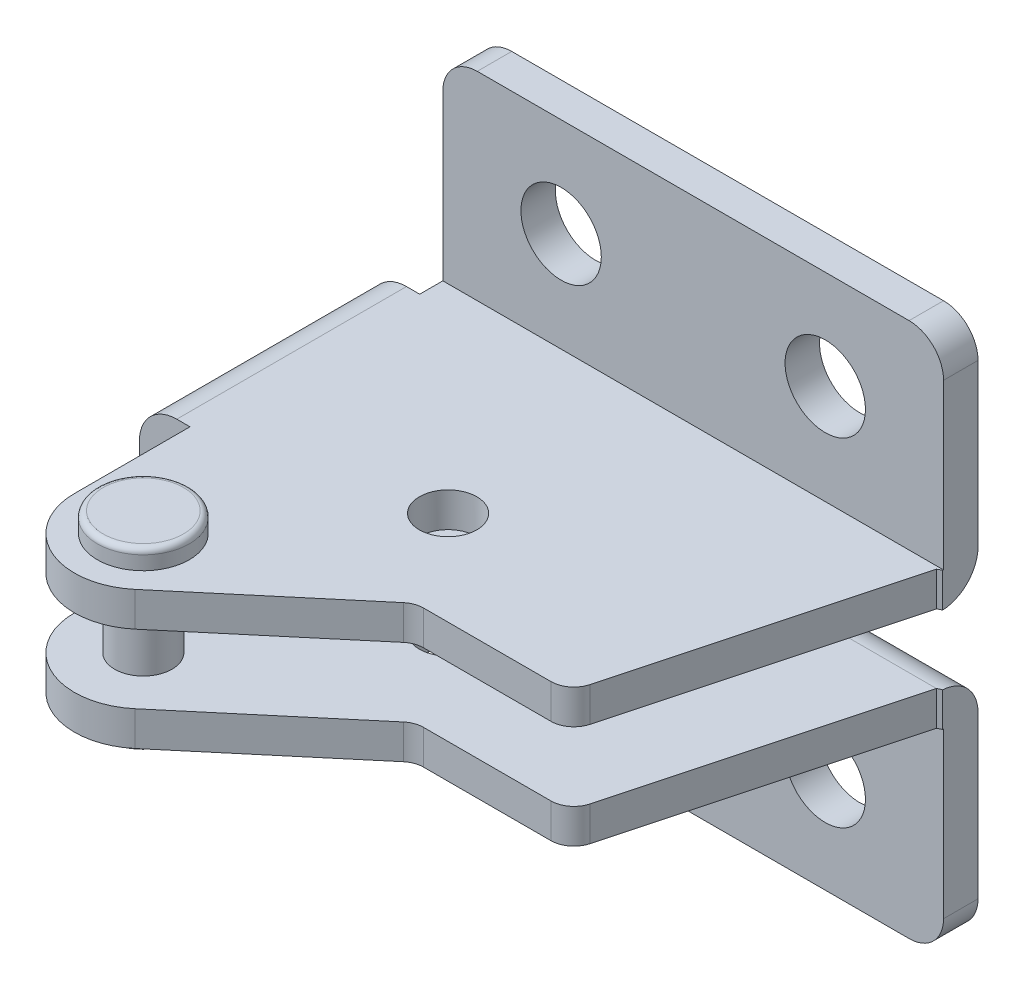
ISO-10303-21;
HEADER;
FILE_DESCRIPTION(('STEP AP214'),'2;1');
FILE_NAME('part.step','',(''),(''),'','','');
FILE_SCHEMA(('AUTOMOTIVE_DESIGN { 1 0 10303 214 1 1 1 1 }'));
ENDSEC;
DATA;
#1=APPLICATION_CONTEXT('core data for automotive mechanical design processes');
#2=APPLICATION_PROTOCOL_DEFINITION('international standard','automotive_design',2000,#1);
#3=PRODUCT_CONTEXT('',#1,'mechanical');
#4=PRODUCT('Part','Part','',(#3));
#5=PRODUCT_RELATED_PRODUCT_CATEGORY('part','',(#4));
#6=PRODUCT_DEFINITION_FORMATION('','',#4);
#7=PRODUCT_DEFINITION_CONTEXT('part definition',#1,'design');
#8=PRODUCT_DEFINITION('design','',#6,#7);
#9=PRODUCT_DEFINITION_SHAPE('','',#8);
#10=(LENGTH_UNIT() NAMED_UNIT(*) SI_UNIT(.MILLI.,.METRE.));
#11=(NAMED_UNIT(*) PLANE_ANGLE_UNIT() SI_UNIT($,.RADIAN.));
#12=(NAMED_UNIT(*) SI_UNIT($,.STERADIAN.) SOLID_ANGLE_UNIT());
#13=UNCERTAINTY_MEASURE_WITH_UNIT(LENGTH_MEASURE(1.E-05),#10,'distance_accuracy_value','');
#14=(GEOMETRIC_REPRESENTATION_CONTEXT(3) GLOBAL_UNCERTAINTY_ASSIGNED_CONTEXT((#13)) GLOBAL_UNIT_ASSIGNED_CONTEXT((#10,
#11,#12)) REPRESENTATION_CONTEXT('',''));
#15=CARTESIAN_POINT('',(0.,0.,0.));
#16=DIRECTION('',(0.,0.,1.));
#17=DIRECTION('',(1.,0.,0.));
#18=AXIS2_PLACEMENT_3D('',#15,#16,#17);
#19=CARTESIAN_POINT('',(24.6261414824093,8.7,26.5102648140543));
#20=DIRECTION('',(0.,1.,0.));
#21=DIRECTION('',(0.,0.,-1.));
#22=AXIS2_PLACEMENT_3D('',#19,#20,#21);
#23=PLANE('',#22);
#24=CARTESIAN_POINT('',(24.6261414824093,8.7,26.5102648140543));
#25=DIRECTION('',(0.,1.,0.));
#26=DIRECTION('',(0.,0.,-1.));
#27=AXIS2_PLACEMENT_3D('',#24,#25,#26);
#28=CIRCLE('',#27,2.00000000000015);
#29=CARTESIAN_POINT('',(24.6261414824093,8.7,28.5102648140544));
#30=VERTEX_POINT('',#29);
#31=CARTESIAN_POINT('',(26.5579931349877,8.7,27.0279029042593));
#32=VERTEX_POINT('',#31);
#33=EDGE_CURVE('E986',#30,#32,#28,.T.);
#34=ORIENTED_EDGE('',*,*,#33,.F.);
#35=DIRECTION('',(1.,0.,0.));
#36=VECTOR('',#35,1.);
#37=CARTESIAN_POINT('',(13.5360000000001,8.7000000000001,28.5102648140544));
#38=LINE('',#37,#36);
#39=CARTESIAN_POINT('',(13.5360000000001,8.7000000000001,28.5102648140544));
#40=VERTEX_POINT('',#39);
#41=EDGE_CURVE('E1002',#40,#30,#38,.T.);
#42=ORIENTED_EDGE('',*,*,#41,.F.);
#43=CARTESIAN_POINT('',(13.5360000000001,8.70000000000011,30.5102648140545));
#44=DIRECTION('',(0.,-1.,0.));
#45=DIRECTION('',(0.,0.,-1.));
#46=AXIS2_PLACEMENT_3D('',#43,#44,#45);
#47=CIRCLE('',#46,2.00000000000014);
#48=CARTESIAN_POINT('',(12.2473100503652,8.70000000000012,28.9807949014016));
#49=VERTEX_POINT('',#48);
#50=EDGE_CURVE('E999',#49,#40,#47,.T.);
#51=ORIENTED_EDGE('',*,*,#50,.F.);
#52=DIRECTION('',(0.764734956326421,0.,-0.644344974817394));
#53=VECTOR('',#52,1.);
#54=CARTESIAN_POINT('',(-0.433930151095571,8.70000000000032,39.6656646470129));
#55=LINE('',#54,#53);
#56=CARTESIAN_POINT('',(-0.433930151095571,8.70000000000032,39.6656646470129));
#57=VERTEX_POINT('',#56);
#58=EDGE_CURVE('E996',#57,#49,#55,.T.);
#59=ORIENTED_EDGE('',*,*,#58,.F.);
#60=CARTESIAN_POINT('',(-4.29999999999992,8.69999999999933,35.0772549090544));
#61=DIRECTION('',(0.,1.,0.));
#62=DIRECTION('',(0.,0.,-1.));
#63=AXIS2_PLACEMENT_3D('',#60,#61,#62);
#64=CIRCLE('',#63,6.);
#65=CARTESIAN_POINT('',(-10.3,8.69999999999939,35.0772549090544));
#66=VERTEX_POINT('',#65);
#67=EDGE_CURVE('E993',#66,#57,#64,.T.);
#68=ORIENTED_EDGE('',*,*,#67,.F.);
#69=DIRECTION('',(0.,0.,1.));
#70=VECTOR('',#69,1.);
#71=CARTESIAN_POINT('',(-10.3,8.70000000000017,3.24999999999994));
#72=LINE('',#71,#70);
#73=CARTESIAN_POINT('',(-10.3,8.70000000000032,25.0130532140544));
#74=VERTEX_POINT('',#73);
#75=EDGE_CURVE('E985',#74,#66,#72,.T.);
#76=ORIENTED_EDGE('',*,*,#75,.F.);
#77=DIRECTION('',(-1.,0.,0.));
#78=VECTOR('',#77,1.);
#79=CARTESIAN_POINT('',(-11.7011064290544,8.70000000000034,25.0130532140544));
#80=LINE('',#79,#78);
#81=CARTESIAN_POINT('',(-11.4511064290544,8.70049319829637,25.0130532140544));
#82=VERTEX_POINT('',#81);
#83=EDGE_CURVE('E611',#74,#82,#80,.T.);
#84=ORIENTED_EDGE('',*,*,#83,.T.);
#85=CARTESIAN_POINT('',(-11.4511064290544,8.7005532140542,5.01305321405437));
#86=DIRECTION('',(0.,0.,1.));
#87=VECTOR('',#86,1.);
#88=LINE('',#85,#87);
#89=CARTESIAN_POINT('',(-11.4511064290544,8.70049319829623,5.01305321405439));
#90=VERTEX_POINT('',#89);
#91=EDGE_CURVE('E734',#90,#82,#88,.T.);
#92=ORIENTED_EDGE('',*,*,#91,.F.);
#93=DIRECTION('',(-1.,0.,0.));
#94=VECTOR('',#93,1.);
#95=CARTESIAN_POINT('',(-11.7011064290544,8.7000000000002,5.01305321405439));
#96=LINE('',#95,#94);
#97=CARTESIAN_POINT('',(-10.3,8.69999999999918,5.01305321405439));
#98=VERTEX_POINT('',#97);
#99=EDGE_CURVE('E602',#98,#90,#96,.T.);
#100=ORIENTED_EDGE('',*,*,#99,.F.);
#101=CARTESIAN_POINT('',(-10.3,8.7000000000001,2.99999999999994));
#102=VERTEX_POINT('',#101);
#103=EDGE_CURVE('E988',#102,#98,#72,.T.);
#104=ORIENTED_EDGE('',*,*,#103,.F.);
#105=DIRECTION('',(1.,0.,0.));
#106=VECTOR('',#105,1.);
#107=CARTESIAN_POINT('',(-64.2,8.7000000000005,2.99999999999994));
#108=LINE('',#107,#106);
#109=CARTESIAN_POINT('',(33.3,8.69999999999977,2.99999999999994));
#110=VERTEX_POINT('',#109);
#111=EDGE_CURVE('E663',#102,#110,#108,.T.);
#112=ORIENTED_EDGE('',*,*,#111,.T.);
#113=DIRECTION('',(0.,0.,1.));
#114=VECTOR('',#113,1.);
#115=CARTESIAN_POINT('',(33.3,8.7,26.5102648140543));
#116=LINE('',#115,#114);
#117=CARTESIAN_POINT('',(33.3,8.69999999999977,3.07230018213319));
#118=VERTEX_POINT('',#117);
#119=EDGE_CURVE('E660',#118,#110,#116,.F.);
#120=ORIENTED_EDGE('',*,*,#119,.F.);
#121=CARTESIAN_POINT('',(32.9292630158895,8.69999999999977,3.24999999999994));
#122=CARTESIAN_POINT('',(32.9601584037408,8.69999999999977,3.2335359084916));
#123=CARTESIAN_POINT('',(32.9910639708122,8.69999999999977,3.21707807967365));
#124=CARTESIAN_POINT('',(33.053141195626,8.69999999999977,3.18467137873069));
#125=CARTESIAN_POINT('',(33.0843128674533,8.69999999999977,3.16872253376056));
#126=CARTESIAN_POINT('',(33.1471688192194,8.69999999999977,3.1378301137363));
#127=CARTESIAN_POINT('',(33.1788531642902,8.69999999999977,3.12288666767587));
#128=CARTESIAN_POINT('',(33.2429508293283,8.69999999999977,3.09464834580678));
#129=CARTESIAN_POINT('',(33.2753643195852,8.69999999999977,3.08135385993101));
#130=CARTESIAN_POINT('',(33.3082451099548,8.69999999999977,3.06920814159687));
#131=B_SPLINE_CURVE_WITH_KNOTS('',3,(#121,#122,#123,#124,#125,#126,#127,#128,#129,#130),
.UNSPECIFIED.,.F.,.F.,(4,2,2,2,4),(0.,0.10503466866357,0.210074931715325,0.315128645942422,
0.42020715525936),.UNSPECIFIED.);
#132=CARTESIAN_POINT('',(32.9292630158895,8.69999999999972,3.24999999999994));
#133=VERTEX_POINT('',#132);
#134=EDGE_CURVE('E648',#133,#118,#131,.T.);
#135=ORIENTED_EDGE('',*,*,#134,.F.);
#136=DIRECTION('',(0.258819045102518,0.,-0.965925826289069));
#137=VECTOR('',#136,1.);
#138=CARTESIAN_POINT('',(26.5579931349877,8.7,27.0279029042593));
#139=LINE('',#138,#137);
#140=EDGE_CURVE('E982',#32,#133,#139,.T.);
#141=ORIENTED_EDGE('',*,*,#140,.F.);
#142=EDGE_LOOP('',(#34,#42,#51,#59,#68,#76,#84,#92,#100,#104,#112,#120,#135,#141));
#143=FACE_BOUND('',#142,.T.);
#144=CARTESIAN_POINT('',(7.46000000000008,8.70000000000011,20.3002648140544));
#145=DIRECTION('',(0.,1.,0.));
#146=DIRECTION('',(0.,0.,-1.));
#147=AXIS2_PLACEMENT_3D('',#144,#145,#146);
#148=CIRCLE('',#147,2.5);
#149=CARTESIAN_POINT('',(7.46000000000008,8.70000000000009,17.8002648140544));
#150=VERTEX_POINT('',#149);
#151=EDGE_CURVE('E608',#150,#150,#148,.T.);
#152=ORIENTED_EDGE('',*,*,#151,.T.);
#153=EDGE_LOOP('',(#152));
#154=FACE_BOUND('',#153,.T.);
#155=CARTESIAN_POINT('',(-4.30000000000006,8.70000000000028,35.0772549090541));
#156=DIRECTION('',(0.,1.,0.));
#157=DIRECTION('',(-1.,0.,0.));
#158=AXIS2_PLACEMENT_3D('',#155,#156,#157);
#159=CIRCLE('',#158,4.);
#160=CARTESIAN_POINT('',(-8.30000000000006,8.70000000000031,35.0772549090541));
#161=VERTEX_POINT('',#160);
#162=EDGE_CURVE('E10',#161,#161,#159,.T.);
#163=ORIENTED_EDGE('',*,*,#162,.T.);
#164=EDGE_LOOP('',(#163));
#165=FACE_BOUND('',#164,.T.);
#166=ADVANCED_FACE('F16',(#143,#154,#165),#23,.F.);
#167=CARTESIAN_POINT('',(-4.3000000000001,20.7005532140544,35.077254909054));
#168=DIRECTION('',(0.,1.,0.));
#169=DIRECTION('',(-0.70312535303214,0.,-0.711065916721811));
#170=AXIS2_PLACEMENT_3D('',#167,#168,#169);
#171=CYLINDRICAL_SURFACE('',#170,4.);
#172=CARTESIAN_POINT('',(-4.30000000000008,21.9005532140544,35.077254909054));
#173=DIRECTION('',(0.,1.,0.));
#174=DIRECTION('',(-0.70312535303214,0.,-0.711065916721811));
#175=AXIS2_PLACEMENT_3D('',#172,#173,#174);
#176=CIRCLE('',#175,4.);
#177=CARTESIAN_POINT('',(-7.11250141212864,21.9005532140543,32.2329912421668));
#178=VERTEX_POINT('',#177);
#179=EDGE_CURVE('E591',#178,#178,#176,.F.);
#180=ORIENTED_EDGE('',*,*,#179,.T.);
#181=EDGE_LOOP('',(#180));
#182=FACE_BOUND('',#181,.T.);
#183=CARTESIAN_POINT('',(-4.3000000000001,20.7005532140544,35.077254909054));
#184=DIRECTION('',(0.,-1.,0.));
#185=DIRECTION('',(0.,0.,-1.));
#186=AXIS2_PLACEMENT_3D('',#183,#184,#185);
#187=CIRCLE('',#186,4.);
#188=CARTESIAN_POINT('',(-4.3000000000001,20.7005532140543,31.077254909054));
#189=VERTEX_POINT('',#188);
#190=EDGE_CURVE('E24',#189,#189,#187,.F.);
#191=ORIENTED_EDGE('',*,*,#190,.T.);
#192=EDGE_LOOP('',(#191));
#193=FACE_BOUND('',#192,.T.);
#194=ADVANCED_FACE('F573',(#182,#193),#171,.T.);
#195=CARTESIAN_POINT('',(-4.30000000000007,22.4005532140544,35.077254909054));
#196=DIRECTION('',(0.,-1.,0.));
#197=DIRECTION('',(0.70312535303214,0.,0.711065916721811));
#198=AXIS2_PLACEMENT_3D('',#195,#196,#197);
#199=PLANE('',#198);
#200=CARTESIAN_POINT('',(-4.30000000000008,22.4005532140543,35.077254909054));
#201=DIRECTION('',(0.,-1.,0.));
#202=DIRECTION('',(0.70312535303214,0.,0.71106591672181));
#203=AXIS2_PLACEMENT_3D('',#200,#201,#202);
#204=CIRCLE('',#203,3.50000000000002);
#205=CARTESIAN_POINT('',(-1.83906126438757,22.4005532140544,37.5659856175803));
#206=VERTEX_POINT('',#205);
#207=CARTESIAN_POINT('',(-6.76093873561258,22.4005532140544,32.5885242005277));
#208=VERTEX_POINT('',#207);
#209=EDGE_CURVE('E924',#206,#208,#204,.T.);
#210=ORIENTED_EDGE('',*,*,#209,.F.);
#211=CARTESIAN_POINT('',(-4.30000000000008,22.4005532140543,35.077254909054));
#212=DIRECTION('',(0.,-1.,0.));
#213=DIRECTION('',(-0.703125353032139,0.,-0.711065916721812));
#214=AXIS2_PLACEMENT_3D('',#211,#212,#213);
#215=CIRCLE('',#214,3.50000000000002);
#216=EDGE_CURVE('E935',#208,#206,#215,.T.);
#217=ORIENTED_EDGE('',*,*,#216,.F.);
#218=EDGE_LOOP('',(#210,#217));
#219=FACE_BOUND('',#218,.T.);
#220=ADVANCED_FACE('F575',(#219),#199,.F.);
#221=CARTESIAN_POINT('',(-4.30000000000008,21.9005532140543,35.077254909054));
#222=DIRECTION('',(0.,-1.,0.));
#223=DIRECTION('',(0.703125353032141,0.,0.711065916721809));
#224=AXIS2_PLACEMENT_3D('',#221,#222,#223);
#225=TOROIDAL_SURFACE('',#224,3.50000000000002,0.5);
#226=ORIENTED_EDGE('',*,*,#209,.T.);
#227=ORIENTED_EDGE('',*,*,#216,.T.);
#228=EDGE_LOOP('',(#226,#227));
#229=FACE_BOUND('',#228,.T.);
#230=ORIENTED_EDGE('',*,*,#179,.F.);
#231=EDGE_LOOP('',(#230));
#232=FACE_BOUND('',#231,.T.);
#233=ADVANCED_FACE('F583',(#229,#232),#225,.T.);
#234=CARTESIAN_POINT('',(23.,-1.85430127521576E-13,-0.00416247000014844));
#235=DIRECTION('',(0.,0.,-1.));
#236=DIRECTION('',(1.,0.,0.));
#237=AXIS2_PLACEMENT_3D('',#234,#235,#236);
#238=CYLINDRICAL_SURFACE('',#237,3.5);
#239=CARTESIAN_POINT('',(23.,-1.1636528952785E-12,2.99999999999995));
#240=DIRECTION('',(0.,0.,-1.));
#241=DIRECTION('',(1.,0.,0.));
#242=AXIS2_PLACEMENT_3D('',#239,#240,#241);
#243=CIRCLE('',#242,3.5);
#244=CARTESIAN_POINT('',(26.5,-1.20031344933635E-12,2.99999999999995));
#245=VERTEX_POINT('',#244);
#246=EDGE_CURVE('E1074',#245,#245,#243,.F.);
#247=ORIENTED_EDGE('',*,*,#246,.T.);
#248=EDGE_LOOP('',(#247));
#249=FACE_BOUND('',#248,.T.);
#250=CARTESIAN_POINT('',(23.,-1.85401061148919E-13,0.));
#251=DIRECTION('',(0.,0.,-1.));
#252=DIRECTION('',(1.,0.,0.));
#253=AXIS2_PLACEMENT_3D('',#250,#251,#252);
#254=CIRCLE('',#253,3.5);
#255=CARTESIAN_POINT('',(26.5,-2.22061615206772E-13,0.));
#256=VERTEX_POINT('',#255);
#257=EDGE_CURVE('E1047',#256,#256,#254,.F.);
#258=ORIENTED_EDGE('',*,*,#257,.F.);
#259=EDGE_LOOP('',(#258));
#260=FACE_BOUND('',#259,.T.);
#261=ADVANCED_FACE('F856',(#249,#260),#238,.F.);
#262=CARTESIAN_POINT('',(0.,0.,-0.00416247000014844));
#263=DIRECTION('',(0.,0.,-1.));
#264=DIRECTION('',(1.,0.,0.));
#265=AXIS2_PLACEMENT_3D('',#262,#263,#264);
#266=CYLINDRICAL_SURFACE('',#265,3.5);
#267=CARTESIAN_POINT('',(0.,-9.22740682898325E-13,2.99999999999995));
#268=DIRECTION('',(0.,0.,-1.));
#269=DIRECTION('',(1.,0.,0.));
#270=AXIS2_PLACEMENT_3D('',#267,#268,#269);
#271=CIRCLE('',#270,3.5);
#272=CARTESIAN_POINT('',(3.49999999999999,-9.59401236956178E-13,2.99999999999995));
#273=VERTEX_POINT('',#272);
#274=EDGE_CURVE('E1071',#273,#273,#271,.F.);
#275=ORIENTED_EDGE('',*,*,#274,.T.);
#276=EDGE_LOOP('',(#275));
#277=FACE_BOUND('',#276,.T.);
#278=CARTESIAN_POINT('',(0.,0.,0.));
#279=DIRECTION('',(0.,0.,-1.));
#280=DIRECTION('',(1.,0.,0.));
#281=AXIS2_PLACEMENT_3D('',#278,#279,#280);
#282=CIRCLE('',#281,3.5);
#283=CARTESIAN_POINT('',(3.49999999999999,0.,0.));
#284=VERTEX_POINT('',#283);
#285=EDGE_CURVE('E1086',#284,#284,#282,.F.);
#286=ORIENTED_EDGE('',*,*,#285,.F.);
#287=EDGE_LOOP('',(#286));
#288=FACE_BOUND('',#287,.T.);
#289=ADVANCED_FACE('F847',(#277,#288),#266,.F.);
#290=CARTESIAN_POINT('',(30.3,-5.60000000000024,3.00000000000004));
#291=DIRECTION('',(0.,0.,-1.));
#292=DIRECTION('',(0.,-1.,0.));
#293=AXIS2_PLACEMENT_3D('',#290,#291,#292);
#294=CYLINDRICAL_SURFACE('',#293,3.);
#295=CARTESIAN_POINT('',(30.3,-5.60000000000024,3.00000000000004));
#296=DIRECTION('',(0.,0.,-1.));
#297=DIRECTION('',(0.,-1.,0.));
#298=AXIS2_PLACEMENT_3D('',#295,#296,#297);
#299=CIRCLE('',#298,3.);
#300=CARTESIAN_POINT('',(33.3,-5.60000000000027,3.00000000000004));
#301=VERTEX_POINT('',#300);
#302=CARTESIAN_POINT('',(30.3,-8.60000000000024,3.00000000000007));
#303=VERTEX_POINT('',#302);
#304=EDGE_CURVE('E1067',#301,#303,#299,.T.);
#305=ORIENTED_EDGE('',*,*,#304,.T.);
#306=DIRECTION('',(0.,0.,-1.));
#307=VECTOR('',#306,1.);
#308=CARTESIAN_POINT('',(30.3,-8.60000000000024,3.00000000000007));
#309=LINE('',#308,#307);
#310=CARTESIAN_POINT('',(30.3,-8.60000000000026,0.));
#311=VERTEX_POINT('',#310);
#312=EDGE_CURVE('E1104',#303,#311,#309,.T.);
#313=ORIENTED_EDGE('',*,*,#312,.T.);
#314=CARTESIAN_POINT('',(30.3,-5.60000000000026,0.));
#315=DIRECTION('',(0.,0.,-1.));
#316=DIRECTION('',(0.,-1.,0.));
#317=AXIS2_PLACEMENT_3D('',#314,#315,#316);
#318=CIRCLE('',#317,3.);
#319=CARTESIAN_POINT('',(33.3,-5.60000000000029,0.));
#320=VERTEX_POINT('',#319);
#321=EDGE_CURVE('E1082',#311,#320,#318,.F.);
#322=ORIENTED_EDGE('',*,*,#321,.T.);
#323=DIRECTION('',(0.,0.,-1.));
#324=VECTOR('',#323,1.);
#325=CARTESIAN_POINT('',(33.3,-5.60000000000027,3.00000000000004));
#326=LINE('',#325,#324);
#327=EDGE_CURVE('E1084',#320,#301,#326,.F.);
#328=ORIENTED_EDGE('',*,*,#327,.T.);
#329=EDGE_LOOP('',(#305,#313,#322,#328));
#330=FACE_BOUND('',#329,.T.);
#331=ADVANCED_FACE('F843',(#330),#294,.T.);
#332=CARTESIAN_POINT('',(30.3,-8.60000000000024,3.00000000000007));
#333=DIRECTION('',(0.,1.,0.));
#334=DIRECTION('',(0.,0.,-1.));
#335=AXIS2_PLACEMENT_3D('',#332,#333,#334);
#336=PLANE('',#335);
#337=ORIENTED_EDGE('',*,*,#312,.F.);
#338=DIRECTION('',(-1.,0.,0.));
#339=VECTOR('',#338,1.);
#340=CARTESIAN_POINT('',(-64.2,-8.59999999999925,3.00000000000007));
#341=LINE('',#340,#339);
#342=CARTESIAN_POINT('',(-7.3,-8.59999999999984,3.00000000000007));
#343=VERTEX_POINT('',#342);
#344=EDGE_CURVE('E1066',#303,#343,#341,.T.);
#345=ORIENTED_EDGE('',*,*,#344,.T.);
#346=DIRECTION('',(0.,0.,-1.));
#347=VECTOR('',#346,1.);
#348=CARTESIAN_POINT('',(-7.3,-8.60000000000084,3.00000000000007));
#349=LINE('',#348,#347);
#350=CARTESIAN_POINT('',(-7.3,-8.60000000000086,0.));
#351=VERTEX_POINT('',#350);
#352=EDGE_CURVE('E1080',#351,#343,#349,.F.);
#353=ORIENTED_EDGE('',*,*,#352,.F.);
#354=DIRECTION('',(-1.,0.,0.));
#355=VECTOR('',#354,1.);
#356=CARTESIAN_POINT('',(30.3,-8.60000000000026,0.));
#357=LINE('',#356,#355);
#358=EDGE_CURVE('E1081',#311,#351,#357,.T.);
#359=ORIENTED_EDGE('',*,*,#358,.F.);
#360=EDGE_LOOP('',(#337,#345,#353,#359));
#361=FACE_BOUND('',#360,.T.);
#362=ADVANCED_FACE('F839',(#361),#336,.F.);
#363=CARTESIAN_POINT('',(23.0000000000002,29.4,-0.00416247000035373));
#364=DIRECTION('',(0.,0.,-1.));
#365=DIRECTION('',(1.,0.,0.));
#366=AXIS2_PLACEMENT_3D('',#363,#364,#365);
#367=CYLINDRICAL_SURFACE('',#366,3.5);
#368=CARTESIAN_POINT('',(23.0000000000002,29.4,2.99999999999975));
#369=DIRECTION('',(0.,0.,1.));
#370=DIRECTION('',(1.,0.,0.));
#371=AXIS2_PLACEMENT_3D('',#368,#369,#370);
#372=CIRCLE('',#371,3.5);
#373=CARTESIAN_POINT('',(26.5000000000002,29.4,2.99999999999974));
#374=VERTEX_POINT('',#373);
#375=EDGE_CURVE('E387',#374,#374,#372,.F.);
#376=ORIENTED_EDGE('',*,*,#375,.F.);
#377=EDGE_LOOP('',(#376));
#378=FACE_BOUND('',#377,.T.);
#379=CARTESIAN_POINT('',(23.0000000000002,29.4,-2.53871360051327E-13));
#380=DIRECTION('',(0.,0.,1.));
#381=DIRECTION('',(1.,0.,0.));
#382=AXIS2_PLACEMENT_3D('',#379,#380,#381);
#383=CIRCLE('',#382,3.5);
#384=CARTESIAN_POINT('',(26.5000000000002,29.4,-2.54433158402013E-13));
#385=VERTEX_POINT('',#384);
#386=EDGE_CURVE('E371',#385,#385,#383,.F.);
#387=ORIENTED_EDGE('',*,*,#386,.T.);
#388=EDGE_LOOP('',(#387));
#389=FACE_BOUND('',#388,.T.);
#390=ADVANCED_FACE('F842',(#378,#389),#367,.F.);
#391=CARTESIAN_POINT('',(2.45498608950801E-13,29.4,-0.00416247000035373));
#392=DIRECTION('',(0.,0.,-1.));
#393=DIRECTION('',(1.,0.,0.));
#394=AXIS2_PLACEMENT_3D('',#391,#392,#393);
#395=CYLINDRICAL_SURFACE('',#394,3.5);
#396=CARTESIAN_POINT('',(2.45498608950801E-13,29.4,2.99999999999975));
#397=DIRECTION('',(0.,0.,1.));
#398=DIRECTION('',(1.,0.,0.));
#399=AXIS2_PLACEMENT_3D('',#396,#397,#398);
#400=CIRCLE('',#399,3.5);
#401=CARTESIAN_POINT('',(3.50000000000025,29.4,2.99999999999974));
#402=VERTEX_POINT('',#401);
#403=EDGE_CURVE('E365',#402,#402,#400,.F.);
#404=ORIENTED_EDGE('',*,*,#403,.F.);
#405=EDGE_LOOP('',(#404));
#406=FACE_BOUND('',#405,.T.);
#407=CARTESIAN_POINT('',(2.45498608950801E-13,29.4,-2.53871360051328E-13));
#408=DIRECTION('',(0.,0.,1.));
#409=DIRECTION('',(1.,0.,0.));
#410=AXIS2_PLACEMENT_3D('',#407,#408,#409);
#411=CIRCLE('',#410,3.5);
#412=CARTESIAN_POINT('',(3.50000000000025,29.4,-2.54433158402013E-13));
#413=VERTEX_POINT('',#412);
#414=EDGE_CURVE('E374',#413,#413,#411,.F.);
#415=ORIENTED_EDGE('',*,*,#414,.T.);
#416=EDGE_LOOP('',(#415));
#417=FACE_BOUND('',#416,.T.);
#418=ADVANCED_FACE('F1211',(#406,#417),#395,.F.);
#419=CARTESIAN_POINT('',(30.3000000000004,38.,2.99999999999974));
#420=DIRECTION('',(0.,-1.,0.));
#421=DIRECTION('',(0.,0.,-1.));
#422=AXIS2_PLACEMENT_3D('',#419,#420,#421);
#423=PLANE('',#422);
#424=DIRECTION('',(0.,0.,-1.));
#425=VECTOR('',#424,1.);
#426=CARTESIAN_POINT('',(30.3000000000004,38.,2.99999999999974));
#427=LINE('',#426,#425);
#428=CARTESIAN_POINT('',(30.3000000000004,38.,2.99999999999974));
#429=VERTEX_POINT('',#428);
#430=CARTESIAN_POINT('',(30.3000000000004,38.,-2.65352581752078E-13));
#431=VERTEX_POINT('',#430);
#432=EDGE_CURVE('E405',#429,#431,#427,.T.);
#433=ORIENTED_EDGE('',*,*,#432,.T.);
#434=DIRECTION('',(-1.,0.,0.));
#435=VECTOR('',#434,1.);
#436=CARTESIAN_POINT('',(30.3000000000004,38.,-2.65352581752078E-13));
#437=LINE('',#436,#435);
#438=CARTESIAN_POINT('',(-7.29999999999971,37.9999999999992,-2.65352581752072E-13));
#439=VERTEX_POINT('',#438);
#440=EDGE_CURVE('E386',#431,#439,#437,.T.);
#441=ORIENTED_EDGE('',*,*,#440,.T.);
#442=DIRECTION('',(0.,0.,-1.));
#443=VECTOR('',#442,1.);
#444=CARTESIAN_POINT('',(-7.29999999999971,37.9999999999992,2.99999999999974));
#445=LINE('',#444,#443);
#446=CARTESIAN_POINT('',(-7.29999999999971,37.9999999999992,2.99999999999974));
#447=VERTEX_POINT('',#446);
#448=EDGE_CURVE('E385',#439,#447,#445,.F.);
#449=ORIENTED_EDGE('',*,*,#448,.T.);
#450=DIRECTION('',(-1.,0.,0.));
#451=VECTOR('',#450,1.);
#452=CARTESIAN_POINT('',(-64.2,38.,2.99999999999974));
#453=LINE('',#452,#451);
#454=EDGE_CURVE('E360',#429,#447,#453,.T.);
#455=ORIENTED_EDGE('',*,*,#454,.F.);
#456=EDGE_LOOP('',(#433,#441,#449,#455));
#457=FACE_BOUND('',#456,.T.);
#458=ADVANCED_FACE('F1215',(#457),#423,.F.);
#459=CARTESIAN_POINT('',(30.3,35.,2.99999999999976));
#460=DIRECTION('',(0.,0.,-1.));
#461=DIRECTION('',(0.,1.,0.));
#462=AXIS2_PLACEMENT_3D('',#459,#460,#461);
#463=CYLINDRICAL_SURFACE('',#462,3.);
#464=CARTESIAN_POINT('',(30.3,35.,2.99999999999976));
#465=DIRECTION('',(0.,0.,1.));
#466=DIRECTION('',(0.,1.,0.));
#467=AXIS2_PLACEMENT_3D('',#464,#465,#466);
#468=CIRCLE('',#467,3.);
#469=CARTESIAN_POINT('',(33.3,35.,2.99999999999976));
#470=VERTEX_POINT('',#469);
#471=EDGE_CURVE('E363',#470,#429,#468,.T.);
#472=ORIENTED_EDGE('',*,*,#471,.F.);
#473=DIRECTION('',(0.,0.,-1.));
#474=VECTOR('',#473,1.);
#475=CARTESIAN_POINT('',(33.3,35.,2.99999999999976));
#476=LINE('',#475,#474);
#477=CARTESIAN_POINT('',(33.3,35.,-2.9297595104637E-13));
#478=VERTEX_POINT('',#477);
#479=EDGE_CURVE('E381',#478,#470,#476,.F.);
#480=ORIENTED_EDGE('',*,*,#479,.F.);
#481=CARTESIAN_POINT('',(30.3,35.,-2.4440369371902E-13));
#482=DIRECTION('',(0.,0.,1.));
#483=DIRECTION('',(0.,1.,0.));
#484=AXIS2_PLACEMENT_3D('',#481,#482,#483);
#485=CIRCLE('',#484,3.);
#486=EDGE_CURVE('E379',#431,#478,#485,.F.);
#487=ORIENTED_EDGE('',*,*,#486,.F.);
#488=ORIENTED_EDGE('',*,*,#432,.F.);
#489=EDGE_LOOP('',(#472,#480,#487,#488));
#490=FACE_BOUND('',#489,.T.);
#491=ADVANCED_FACE('F852',(#490),#463,.T.);
#492=CARTESIAN_POINT('',(33.3,9.81583752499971,2.99999999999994));
#493=DIRECTION('',(-1.,0.,0.));
#494=DIRECTION('',(0.,-1.,0.));
#495=AXIS2_PLACEMENT_3D('',#492,#493,#494);
#496=PLANE('',#495);
#497=CARTESIAN_POINT('',(33.3,8.44999999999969,3.24999999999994));
#498=DIRECTION('',(1.,0.,0.));
#499=DIRECTION('',(0.,1.,0.));
#500=AXIS2_PLACEMENT_3D('',#497,#498,#499);
#501=CIRCLE('',#500,3.25);
#502=CARTESIAN_POINT('',(33.3,11.6951383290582,3.07230018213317));
#503=VERTEX_POINT('',#502);
#504=CARTESIAN_POINT('',(33.3,8.45055321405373,0.));
#505=VERTEX_POINT('',#504);
#506=EDGE_CURVE('E600',#503,#505,#501,.F.);
#507=ORIENTED_EDGE('',*,*,#506,.F.);
#508=DIRECTION('',(0.,1.,0.));
#509=VECTOR('',#508,1.);
#510=CARTESIAN_POINT('',(33.3,8.6258486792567,3.07230018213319));
#511=LINE('',#510,#509);
#512=EDGE_CURVE('E656',#503,#118,#511,.F.);
#513=ORIENTED_EDGE('',*,*,#512,.T.);
#514=ORIENTED_EDGE('',*,*,#119,.T.);
#515=DIRECTION('',(0.,-1.,0.));
#516=VECTOR('',#515,1.);
#517=CARTESIAN_POINT('',(33.3,-5.60000000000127,3.00000000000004));
#518=LINE('',#517,#516);
#519=EDGE_CURVE('E1070',#110,#301,#518,.T.);
#520=ORIENTED_EDGE('',*,*,#519,.T.);
#521=ORIENTED_EDGE('',*,*,#327,.F.);
#522=DIRECTION('',(0.,-1.,0.));
#523=VECTOR('',#522,1.);
#524=CARTESIAN_POINT('',(33.3,9.81583752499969,0.));
#525=LINE('',#524,#523);
#526=EDGE_CURVE('E1085',#505,#320,#525,.T.);
#527=ORIENTED_EDGE('',*,*,#526,.F.);
#528=EDGE_LOOP('',(#507,#513,#514,#520,#521,#527));
#529=FACE_BOUND('',#528,.T.);
#530=ADVANCED_FACE('F849',(#529),#496,.F.);
#531=CARTESIAN_POINT('',(32.9292630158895,7.69999999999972,3.24999999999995));
#532=CARTESIAN_POINT('',(33.052842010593,7.69999999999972,3.18411384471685));
#533=CARTESIAN_POINT('',(33.1764210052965,7.69999999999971,3.11864416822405));
#534=CARTESIAN_POINT('',(33.3,7.69999999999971,3.0723001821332));
#535=B_SPLINE_CURVE_WITH_KNOTS('',3,(#531,#532,#533,#534),.UNSPECIFIED.,.F.,.F.,(4,4),(0.,1.),.UNSPECIFIED.);
#536=DIRECTION('',(0.,1.,0.));
#537=VECTOR('',#536,1.);
#538=SURFACE_OF_LINEAR_EXTRUSION('',#535,#537);
#539=ORIENTED_EDGE('',*,*,#512,.F.);
#540=CARTESIAN_POINT('',(33.3,11.6951383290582,3.07230018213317));
#541=CARTESIAN_POINT('',(33.2671919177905,11.6958179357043,3.08462887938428));
#542=CARTESIAN_POINT('',(33.2348471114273,11.6964799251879,3.09808047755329));
#543=CARTESIAN_POINT('',(33.1708725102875,11.6976859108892,3.12658318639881));
#544=CARTESIAN_POINT('',(33.1392425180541,11.6982299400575,3.14163384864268));
#545=CARTESIAN_POINT('',(33.076472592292,11.6991176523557,3.17269368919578));
#546=CARTESIAN_POINT('',(33.0453325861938,11.6994613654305,3.18870272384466));
#547=CARTESIAN_POINT('',(32.9832975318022,11.6999140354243,3.22118957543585));
#548=CARTESIAN_POINT('',(32.9524024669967,11.7000230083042,3.23766736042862));
#549=CARTESIAN_POINT('',(32.9215076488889,11.6999973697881,3.254134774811));
#550=B_SPLINE_CURVE_WITH_KNOTS('',3,(#540,#541,#542,#543,#544,#545,#546,#547,#548,#549),
.UNSPECIFIED.,.F.,.F.,(4,2,2,2,4),(0.,0.105088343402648,0.210147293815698,0.315190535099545,
0.420226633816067),.UNSPECIFIED.);
#551=CARTESIAN_POINT('',(32.9292630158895,11.6999999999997,3.24999999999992));
#552=VERTEX_POINT('',#551);
#553=EDGE_CURVE('E545',#503,#552,#550,.T.);
#554=ORIENTED_EDGE('',*,*,#553,.T.);
#555=DIRECTION('',(0.,-1.,0.));
#556=VECTOR('',#555,1.);
#557=CARTESIAN_POINT('',(32.9292630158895,8.70055321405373,3.24999999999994));
#558=LINE('',#557,#556);
#559=EDGE_CURVE('E758',#552,#133,#558,.T.);
#560=ORIENTED_EDGE('',*,*,#559,.T.);
#561=ORIENTED_EDGE('',*,*,#134,.T.);
#562=EDGE_LOOP('',(#539,#554,#560,#561));
#563=FACE_BOUND('',#562,.T.);
#564=ADVANCED_FACE('F636',(#563),#538,.T.);
#565=CARTESIAN_POINT('',(-64.2,-5.60000000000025,3.00000000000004));
#566=DIRECTION('',(0.,0.,-1.));
#567=DIRECTION('',(0.,-1.,0.));
#568=AXIS2_PLACEMENT_3D('',#565,#566,#567);
#569=PLANE('',#568);
#570=DIRECTION('',(0.,-1.,0.));
#571=VECTOR('',#570,1.);
#572=CARTESIAN_POINT('',(-10.3,-5.60000000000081,3.00000000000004));
#573=LINE('',#572,#571);
#574=CARTESIAN_POINT('',(-10.3,-5.60000000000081,3.00000000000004));
#575=VERTEX_POINT('',#574);
#576=EDGE_CURVE('E1065',#575,#102,#573,.F.);
#577=ORIENTED_EDGE('',*,*,#576,.F.);
#578=CARTESIAN_POINT('',(-7.3,-5.60000000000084,3.00000000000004));
#579=DIRECTION('',(0.,0.,-1.));
#580=DIRECTION('',(0.,-1.,0.));
#581=AXIS2_PLACEMENT_3D('',#578,#579,#580);
#582=CIRCLE('',#581,3.);
#583=EDGE_CURVE('E1062',#343,#575,#582,.T.);
#584=ORIENTED_EDGE('',*,*,#583,.F.);
#585=ORIENTED_EDGE('',*,*,#344,.F.);
#586=ORIENTED_EDGE('',*,*,#304,.F.);
#587=ORIENTED_EDGE('',*,*,#519,.F.);
#588=ORIENTED_EDGE('',*,*,#111,.F.);
#589=EDGE_LOOP('',(#577,#584,#585,#586,#587,#588));
#590=FACE_BOUND('',#589,.T.);
#591=ORIENTED_EDGE('',*,*,#274,.F.);
#592=EDGE_LOOP('',(#591));
#593=FACE_BOUND('',#592,.T.);
#594=ORIENTED_EDGE('',*,*,#246,.F.);
#595=EDGE_LOOP('',(#594));
#596=FACE_BOUND('',#595,.T.);
#597=ADVANCED_FACE('F828',(#590,#593,#596),#569,.F.);
#598=CARTESIAN_POINT('',(-7.3,-5.60000000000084,3.00000000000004));
#599=DIRECTION('',(0.,0.,-1.));
#600=DIRECTION('',(0.,-1.,0.));
#601=AXIS2_PLACEMENT_3D('',#598,#599,#600);
#602=CYLINDRICAL_SURFACE('',#601,3.);
#603=ORIENTED_EDGE('',*,*,#583,.T.);
#604=DIRECTION('',(0.,0.,1.));
#605=VECTOR('',#604,1.);
#606=CARTESIAN_POINT('',(-10.3,-5.60000000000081,2.99999999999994));
#607=LINE('',#606,#605);
#608=CARTESIAN_POINT('',(-10.3,-5.60000000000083,0.));
#609=VERTEX_POINT('',#608);
#610=EDGE_CURVE('E1100',#575,#609,#607,.F.);
#611=ORIENTED_EDGE('',*,*,#610,.T.);
#612=CARTESIAN_POINT('',(-7.3,-5.60000000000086,0.));
#613=DIRECTION('',(0.,0.,-1.));
#614=DIRECTION('',(0.,-1.,0.));
#615=AXIS2_PLACEMENT_3D('',#612,#613,#614);
#616=CIRCLE('',#615,3.);
#617=EDGE_CURVE('E1078',#609,#351,#616,.F.);
#618=ORIENTED_EDGE('',*,*,#617,.T.);
#619=ORIENTED_EDGE('',*,*,#352,.T.);
#620=EDGE_LOOP('',(#603,#611,#618,#619));
#621=FACE_BOUND('',#620,.T.);
#622=ADVANCED_FACE('F831',(#621),#602,.T.);
#623=CARTESIAN_POINT('',(-64.2,-5.60000000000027,0.));
#624=DIRECTION('',(0.,0.,-1.));
#625=DIRECTION('',(0.,-1.,0.));
#626=AXIS2_PLACEMENT_3D('',#623,#624,#625);
#627=PLANE('',#626);
#628=ORIENTED_EDGE('',*,*,#358,.T.);
#629=ORIENTED_EDGE('',*,*,#617,.F.);
#630=DIRECTION('',(0.,1.,0.));
#631=VECTOR('',#630,1.);
#632=CARTESIAN_POINT('',(-10.2999999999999,12.9624999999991,0.));
#633=LINE('',#632,#631);
#634=CARTESIAN_POINT('',(-10.3,8.45055321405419,0.));
#635=VERTEX_POINT('',#634);
#636=EDGE_CURVE('E1097',#609,#635,#633,.T.);
#637=ORIENTED_EDGE('',*,*,#636,.T.);
#638=DIRECTION('',(1.,0.,0.));
#639=VECTOR('',#638,1.);
#640=CARTESIAN_POINT('',(-32.4748240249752,8.45055321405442,0.));
#641=LINE('',#640,#639);
#642=EDGE_CURVE('E1077',#505,#635,#641,.F.);
#643=ORIENTED_EDGE('',*,*,#642,.F.);
#644=ORIENTED_EDGE('',*,*,#526,.T.);
#645=ORIENTED_EDGE('',*,*,#321,.F.);
#646=EDGE_LOOP('',(#628,#629,#637,#643,#644,#645));
#647=FACE_BOUND('',#646,.T.);
#648=ORIENTED_EDGE('',*,*,#285,.T.);
#649=EDGE_LOOP('',(#648));
#650=FACE_BOUND('',#649,.T.);
#651=ORIENTED_EDGE('',*,*,#257,.T.);
#652=EDGE_LOOP('',(#651));
#653=FACE_BOUND('',#652,.T.);
#654=ADVANCED_FACE('F796',(#647,#650,#653),#627,.T.);
#655=CARTESIAN_POINT('',(-11.4511064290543,11.9505532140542,-5.39666054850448));
#656=DIRECTION('',(0.,0.,1.));
#657=DIRECTION('',(-1.,0.,0.));
#658=AXIS2_PLACEMENT_3D('',#655,#656,#657);
#659=CYLINDRICAL_SURFACE('',#658,0.25);
#660=DIRECTION('',(0.,0.,1.));
#661=VECTOR('',#660,1.);
#662=CARTESIAN_POINT('',(-11.7011064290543,11.9505532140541,-13.5494467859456));
#663=LINE('',#662,#661);
#664=CARTESIAN_POINT('',(-11.7011064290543,11.9505532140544,25.0130532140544));
#665=VERTEX_POINT('',#664);
#666=CARTESIAN_POINT('',(-11.7011064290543,11.9505532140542,5.01305321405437));
#667=VERTEX_POINT('',#666);
#668=EDGE_CURVE('E748',#665,#667,#663,.F.);
#669=ORIENTED_EDGE('',*,*,#668,.F.);
#670=CARTESIAN_POINT('',(-11.4511064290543,11.9505532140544,25.0130532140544));
#671=DIRECTION('',(0.,0.,1.));
#672=DIRECTION('',(-1.,0.,0.));
#673=AXIS2_PLACEMENT_3D('',#670,#671,#672);
#674=CIRCLE('',#673,0.25);
#675=CARTESIAN_POINT('',(-11.4511064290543,11.7005532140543,25.0130532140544));
#676=VERTEX_POINT('',#675);
#677=EDGE_CURVE('E750',#676,#665,#674,.F.);
#678=ORIENTED_EDGE('',*,*,#677,.F.);
#679=DIRECTION('',(0.,0.,1.));
#680=VECTOR('',#679,1.);
#681=CARTESIAN_POINT('',(-11.4511064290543,11.7005532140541,-5.39666054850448));
#682=LINE('',#681,#680);
#683=CARTESIAN_POINT('',(-11.4511064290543,11.7005532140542,5.01305321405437));
#684=VERTEX_POINT('',#683);
#685=EDGE_CURVE('E751',#684,#676,#682,.T.);
#686=ORIENTED_EDGE('',*,*,#685,.F.);
#687=CARTESIAN_POINT('',(-11.4511064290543,11.9505532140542,5.01305321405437));
#688=DIRECTION('',(0.,0.,1.));
#689=DIRECTION('',(-1.,0.,0.));
#690=AXIS2_PLACEMENT_3D('',#687,#688,#689);
#691=CIRCLE('',#690,0.25);
#692=EDGE_CURVE('E753',#667,#684,#691,.T.);
#693=ORIENTED_EDGE('',*,*,#692,.F.);
#694=EDGE_LOOP('',(#669,#678,#686,#693));
#695=FACE_BOUND('',#694,.T.);
#696=ADVANCED_FACE('F792',(#695),#659,.F.);
#697=CARTESIAN_POINT('',(-11.7011064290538,61.9505532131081,-13.5494467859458));
#698=DIRECTION('',(1.,0.,0.));
#699=DIRECTION('',(0.,1.,0.));
#700=AXIS2_PLACEMENT_3D('',#697,#698,#699);
#701=PLANE('',#700);
#702=DIRECTION('',(0.,-1.,0.));
#703=VECTOR('',#702,1.);
#704=CARTESIAN_POINT('',(-11.7011064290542,21.3505532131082,5.01305321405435));
#705=LINE('',#704,#703);
#706=CARTESIAN_POINT('',(-11.7011064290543,17.4494467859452,5.01305321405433));
#707=VERTEX_POINT('',#706);
#708=EDGE_CURVE('E745',#667,#707,#705,.F.);
#709=ORIENTED_EDGE('',*,*,#708,.T.);
#710=DIRECTION('',(0.,0.,1.));
#711=VECTOR('',#710,1.);
#712=CARTESIAN_POINT('',(-11.7011064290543,17.4494467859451,-13.5494467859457));
#713=LINE('',#712,#711);
#714=CARTESIAN_POINT('',(-11.7011064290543,17.4494467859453,25.0130532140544));
#715=VERTEX_POINT('',#714);
#716=EDGE_CURVE('E400',#715,#707,#713,.F.);
#717=ORIENTED_EDGE('',*,*,#716,.F.);
#718=DIRECTION('',(0.,-1.,0.));
#719=VECTOR('',#718,1.);
#720=CARTESIAN_POINT('',(-11.7011064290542,21.3505532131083,25.0130532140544));
#721=LINE('',#720,#719);
#722=EDGE_CURVE('E736',#715,#665,#721,.T.);
#723=ORIENTED_EDGE('',*,*,#722,.T.);
#724=ORIENTED_EDGE('',*,*,#668,.T.);
#725=EDGE_LOOP('',(#709,#717,#723,#724));
#726=FACE_BOUND('',#725,.T.);
#727=ADVANCED_FACE('F789',(#726),#701,.T.);
#728=CARTESIAN_POINT('',(-11.4511064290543,17.4494467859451,-5.39666054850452));
#729=DIRECTION('',(0.,0.,1.));
#730=DIRECTION('',(-1.,0.,0.));
#731=AXIS2_PLACEMENT_3D('',#728,#729,#730);
#732=CYLINDRICAL_SURFACE('',#731,0.25);
#733=ORIENTED_EDGE('',*,*,#716,.T.);
#734=CARTESIAN_POINT('',(-11.4511064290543,17.4494467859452,5.01305321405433));
#735=DIRECTION('',(0.,0.,-1.));
#736=DIRECTION('',(-1.,0.,0.));
#737=AXIS2_PLACEMENT_3D('',#734,#735,#736);
#738=CIRCLE('',#737,0.25);
#739=CARTESIAN_POINT('',(-11.4511064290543,17.6994467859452,5.01305321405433));
#740=VERTEX_POINT('',#739);
#741=EDGE_CURVE('E341',#707,#740,#738,.T.);
#742=ORIENTED_EDGE('',*,*,#741,.T.);
#743=DIRECTION('',(0.,0.,1.));
#744=VECTOR('',#743,1.);
#745=CARTESIAN_POINT('',(-11.4511064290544,17.6994467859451,-5.39666054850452));
#746=LINE('',#745,#744);
#747=CARTESIAN_POINT('',(-11.4511064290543,17.6994467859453,25.0130532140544));
#748=VERTEX_POINT('',#747);
#749=EDGE_CURVE('E337',#740,#748,#746,.T.);
#750=ORIENTED_EDGE('',*,*,#749,.T.);
#751=CARTESIAN_POINT('',(-11.4511064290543,17.4494467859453,25.0130532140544));
#752=DIRECTION('',(0.,0.,-1.));
#753=DIRECTION('',(-1.,0.,0.));
#754=AXIS2_PLACEMENT_3D('',#751,#752,#753);
#755=CIRCLE('',#754,0.25);
#756=EDGE_CURVE('E397',#748,#715,#755,.F.);
#757=ORIENTED_EDGE('',*,*,#756,.T.);
#758=EDGE_LOOP('',(#733,#742,#750,#757));
#759=FACE_BOUND('',#758,.T.);
#760=ADVANCED_FACE('F702',(#759),#732,.F.);
#761=CARTESIAN_POINT('',(-14.7011064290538,61.9505532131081,-13.5494467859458));
#762=DIRECTION('',(1.,0.,0.));
#763=DIRECTION('',(0.,1.,0.));
#764=AXIS2_PLACEMENT_3D('',#761,#762,#763);
#765=PLANE('',#764);
#766=DIRECTION('',(0.,1.,0.));
#767=VECTOR('',#766,1.);
#768=CARTESIAN_POINT('',(-14.7011064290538,61.9505532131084,25.0130532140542));
#769=LINE('',#768,#767);
#770=CARTESIAN_POINT('',(-14.7011064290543,17.4494467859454,25.0130532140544));
#771=VERTEX_POINT('',#770);
#772=CARTESIAN_POINT('',(-14.7011064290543,11.9505532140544,25.0130532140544));
#773=VERTEX_POINT('',#772);
#774=EDGE_CURVE('E725',#771,#773,#769,.F.);
#775=ORIENTED_EDGE('',*,*,#774,.F.);
#776=DIRECTION('',(0.,0.,1.));
#777=VECTOR('',#776,1.);
#778=CARTESIAN_POINT('',(-14.7011064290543,17.4494467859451,-13.5494467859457));
#779=LINE('',#778,#777);
#780=CARTESIAN_POINT('',(-14.7011064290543,17.4494467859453,5.01305321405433));
#781=VERTEX_POINT('',#780);
#782=EDGE_CURVE('E492',#771,#781,#779,.F.);
#783=ORIENTED_EDGE('',*,*,#782,.T.);
#784=DIRECTION('',(0.,1.,0.));
#785=VECTOR('',#784,1.);
#786=CARTESIAN_POINT('',(-14.7011064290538,61.9505532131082,5.01305321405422));
#787=LINE('',#786,#785);
#788=CARTESIAN_POINT('',(-14.7011064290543,11.9505532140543,5.01305321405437));
#789=VERTEX_POINT('',#788);
#790=EDGE_CURVE('E721',#789,#781,#787,.T.);
#791=ORIENTED_EDGE('',*,*,#790,.F.);
#792=DIRECTION('',(0.,0.,1.));
#793=VECTOR('',#792,1.);
#794=CARTESIAN_POINT('',(-14.7011064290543,11.9505532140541,-13.5494467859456));
#795=LINE('',#794,#793);
#796=EDGE_CURVE('E730',#773,#789,#795,.F.);
#797=ORIENTED_EDGE('',*,*,#796,.F.);
#798=EDGE_LOOP('',(#775,#783,#791,#797));
#799=FACE_BOUND('',#798,.T.);
#800=ADVANCED_FACE('F738',(#799),#765,.F.);
#801=CARTESIAN_POINT('',(-64.2,35.,-2.44403693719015E-13));
#802=DIRECTION('',(0.,0.,-1.));
#803=DIRECTION('',(0.,1.,0.));
#804=AXIS2_PLACEMENT_3D('',#801,#802,#803);
#805=PLANE('',#804);
#806=ORIENTED_EDGE('',*,*,#440,.F.);
#807=ORIENTED_EDGE('',*,*,#486,.T.);
#808=DIRECTION('',(0.,1.,0.));
#809=VECTOR('',#808,1.);
#810=CARTESIAN_POINT('',(33.3,19.5841624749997,-1.36755475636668E-13));
#811=LINE('',#810,#809);
#812=CARTESIAN_POINT('',(33.3,20.9494467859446,-1.46289205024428E-13));
#813=VERTEX_POINT('',#812);
#814=EDGE_CURVE('E378',#813,#478,#811,.T.);
#815=ORIENTED_EDGE('',*,*,#814,.F.);
#816=DIRECTION('',(1.,0.,0.));
#817=VECTOR('',#816,1.);
#818=CARTESIAN_POINT('',(-32.4748240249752,20.9494467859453,-1.46289205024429E-13));
#819=LINE('',#818,#817);
#820=CARTESIAN_POINT('',(-10.2999999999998,20.9494467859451,-1.46289205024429E-13));
#821=VERTEX_POINT('',#820);
#822=EDGE_CURVE('E368',#813,#821,#819,.F.);
#823=ORIENTED_EDGE('',*,*,#822,.T.);
#824=DIRECTION('',(0.,-1.,0.));
#825=VECTOR('',#824,1.);
#826=CARTESIAN_POINT('',(-10.3,16.4374999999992,0.));
#827=LINE('',#826,#825);
#828=CARTESIAN_POINT('',(-10.2999999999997,34.9999999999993,-2.44403693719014E-13));
#829=VERTEX_POINT('',#828);
#830=EDGE_CURVE('E412',#829,#821,#827,.T.);
#831=ORIENTED_EDGE('',*,*,#830,.F.);
#832=CARTESIAN_POINT('',(-7.29999999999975,34.9999999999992,-2.44403693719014E-13));
#833=DIRECTION('',(0.,0.,1.));
#834=DIRECTION('',(0.,1.,0.));
#835=AXIS2_PLACEMENT_3D('',#832,#833,#834);
#836=CIRCLE('',#835,3.);
#837=EDGE_CURVE('E382',#829,#439,#836,.F.);
#838=ORIENTED_EDGE('',*,*,#837,.T.);
#839=EDGE_LOOP('',(#806,#807,#815,#823,#831,#838));
#840=FACE_BOUND('',#839,.T.);
#841=ORIENTED_EDGE('',*,*,#414,.F.);
#842=EDGE_LOOP('',(#841));
#843=FACE_BOUND('',#842,.T.);
#844=ORIENTED_EDGE('',*,*,#386,.F.);
#845=EDGE_LOOP('',(#844));
#846=FACE_BOUND('',#845,.T.);
#847=ADVANCED_FACE('F421',(#840,#843,#846),#805,.T.);
#848=CARTESIAN_POINT('',(-7.29999999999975,34.9999999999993,2.99999999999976));
#849=DIRECTION('',(0.,0.,-1.));
#850=DIRECTION('',(0.,1.,0.));
#851=AXIS2_PLACEMENT_3D('',#848,#849,#850);
#852=CYLINDRICAL_SURFACE('',#851,3.);
#853=CARTESIAN_POINT('',(-7.29999999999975,34.9999999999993,2.99999999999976));
#854=DIRECTION('',(0.,0.,1.));
#855=DIRECTION('',(0.,1.,0.));
#856=AXIS2_PLACEMENT_3D('',#853,#854,#855);
#857=CIRCLE('',#856,3.);
#858=CARTESIAN_POINT('',(-10.2999999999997,34.9999999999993,2.99999999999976));
#859=VERTEX_POINT('',#858);
#860=EDGE_CURVE('E359',#447,#859,#857,.T.);
#861=ORIENTED_EDGE('',*,*,#860,.F.);
#862=ORIENTED_EDGE('',*,*,#448,.F.);
#863=ORIENTED_EDGE('',*,*,#837,.F.);
#864=DIRECTION('',(0.,0.,1.));
#865=VECTOR('',#864,1.);
#866=CARTESIAN_POINT('',(-10.2999999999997,34.9999999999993,2.99999999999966));
#867=LINE('',#866,#865);
#868=EDGE_CURVE('E410',#859,#829,#867,.F.);
#869=ORIENTED_EDGE('',*,*,#868,.F.);
#870=EDGE_LOOP('',(#861,#862,#863,#869));
#871=FACE_BOUND('',#870,.T.);
#872=ADVANCED_FACE('F1201',(#871),#852,.T.);
#873=CARTESIAN_POINT('',(-64.2,35.,2.99999999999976));
#874=DIRECTION('',(0.,0.,-1.));
#875=DIRECTION('',(0.,1.,0.));
#876=AXIS2_PLACEMENT_3D('',#873,#874,#875);
#877=PLANE('',#876);
#878=DIRECTION('',(0.,1.,0.));
#879=VECTOR('',#878,1.);
#880=CARTESIAN_POINT('',(-10.2999999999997,35.,2.99999999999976));
#881=LINE('',#880,#879);
#882=CARTESIAN_POINT('',(-10.2999999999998,20.7,2.99999999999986));
#883=VERTEX_POINT('',#882);
#884=EDGE_CURVE('E356',#859,#883,#881,.F.);
#885=ORIENTED_EDGE('',*,*,#884,.T.);
#886=DIRECTION('',(1.,0.,0.));
#887=VECTOR('',#886,1.);
#888=CARTESIAN_POINT('',(24.6261414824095,20.7,2.99999999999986));
#889=LINE('',#888,#887);
#890=CARTESIAN_POINT('',(33.3,20.6999999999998,2.99999999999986));
#891=VERTEX_POINT('',#890);
#892=EDGE_CURVE('E547',#883,#891,#889,.T.);
#893=ORIENTED_EDGE('',*,*,#892,.T.);
#894=DIRECTION('',(0.,1.,0.));
#895=VECTOR('',#894,1.);
#896=CARTESIAN_POINT('',(33.3,35.,2.99999999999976));
#897=LINE('',#896,#895);
#898=EDGE_CURVE('E31',#891,#470,#897,.T.);
#899=ORIENTED_EDGE('',*,*,#898,.T.);
#900=ORIENTED_EDGE('',*,*,#471,.T.);
#901=ORIENTED_EDGE('',*,*,#454,.T.);
#902=ORIENTED_EDGE('',*,*,#860,.T.);
#903=EDGE_LOOP('',(#885,#893,#899,#900,#901,#902));
#904=FACE_BOUND('',#903,.T.);
#905=ORIENTED_EDGE('',*,*,#403,.T.);
#906=EDGE_LOOP('',(#905));
#907=FACE_BOUND('',#906,.T.);
#908=ORIENTED_EDGE('',*,*,#375,.T.);
#909=EDGE_LOOP('',(#908));
#910=FACE_BOUND('',#909,.T.);
#911=ADVANCED_FACE('F1184',(#904,#907,#910),#877,.F.);
#912=CARTESIAN_POINT('',(33.3,19.5841624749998,2.99999999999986));
#913=DIRECTION('',(-1.,0.,0.));
#914=DIRECTION('',(0.,1.,0.));
#915=AXIS2_PLACEMENT_3D('',#912,#913,#914);
#916=PLANE('',#915);
#917=DIRECTION('',(0.,0.,1.));
#918=VECTOR('',#917,1.);
#919=CARTESIAN_POINT('',(33.3,20.6999999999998,2.99999999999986));
#920=LINE('',#919,#918);
#921=CARTESIAN_POINT('',(33.3,20.6999999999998,3.0723001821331));
#922=VERTEX_POINT('',#921);
#923=EDGE_CURVE('E544',#922,#891,#920,.F.);
#924=ORIENTED_EDGE('',*,*,#923,.F.);
#925=DIRECTION('',(0.,-1.,0.));
#926=VECTOR('',#925,1.);
#927=CARTESIAN_POINT('',(33.3,20.7735980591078,3.0723001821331));
#928=LINE('',#927,#926);
#929=CARTESIAN_POINT('',(33.3,17.7048616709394,3.07230018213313));
#930=VERTEX_POINT('',#929);
#931=EDGE_CURVE('E39',#922,#930,#928,.T.);
#932=ORIENTED_EDGE('',*,*,#931,.T.);
#933=CARTESIAN_POINT('',(33.3,20.9499999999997,3.24999999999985));
#934=DIRECTION('',(-1.,0.,0.));
#935=DIRECTION('',(0.,-1.,0.));
#936=AXIS2_PLACEMENT_3D('',#933,#934,#935);
#937=CIRCLE('',#936,3.25);
#938=EDGE_CURVE('E432',#930,#813,#937,.F.);
#939=ORIENTED_EDGE('',*,*,#938,.T.);
#940=ORIENTED_EDGE('',*,*,#814,.T.);
#941=ORIENTED_EDGE('',*,*,#479,.T.);
#942=ORIENTED_EDGE('',*,*,#898,.F.);
#943=EDGE_LOOP('',(#924,#932,#939,#940,#941,#942));
#944=FACE_BOUND('',#943,.T.);
#945=ADVANCED_FACE('F681',(#944),#916,.F.);
#946=CARTESIAN_POINT('',(32.9292630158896,21.6999999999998,3.24999999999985));
#947=CARTESIAN_POINT('',(33.0528420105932,21.6999999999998,3.18411384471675));
#948=CARTESIAN_POINT('',(33.1764210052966,21.6999999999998,3.11864416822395));
#949=CARTESIAN_POINT('',(33.3,21.6999999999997,3.0723001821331));
#950=B_SPLINE_CURVE_WITH_KNOTS('',3,(#946,#947,#948,#949),.UNSPECIFIED.,.F.,.F.,(4,4),(0.,1.),.UNSPECIFIED.);
#951=DIRECTION('',(0.,-1.,0.));
#952=VECTOR('',#951,1.);
#953=SURFACE_OF_LINEAR_EXTRUSION('',#950,#952);
#954=CARTESIAN_POINT('',(32.9292630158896,20.7,3.24999999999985));
#955=CARTESIAN_POINT('',(32.960158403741,20.7000000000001,3.2335359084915));
#956=CARTESIAN_POINT('',(32.9910639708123,20.7000000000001,3.21707807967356));
#957=CARTESIAN_POINT('',(33.0531411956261,20.6999999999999,3.18467137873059));
#958=CARTESIAN_POINT('',(33.0843128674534,20.6999999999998,3.16872253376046));
#959=CARTESIAN_POINT('',(33.1471688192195,20.6999999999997,3.13783011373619));
#960=CARTESIAN_POINT('',(33.1788531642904,20.6999999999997,3.12288666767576));
#961=CARTESIAN_POINT('',(33.2429508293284,20.6999999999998,3.09464834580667));
#962=CARTESIAN_POINT('',(33.2753643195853,20.6999999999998,3.0813538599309));
#963=CARTESIAN_POINT('',(33.3082451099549,20.6999999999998,3.06920814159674));
#964=B_SPLINE_CURVE_WITH_KNOTS('',3,(#954,#955,#956,#957,#958,#959,#960,#961,#962,#963),
.UNSPECIFIED.,.F.,.F.,(4,2,2,2,4),(0.,0.105034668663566,0.21007493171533,0.315128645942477,
0.420207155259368),.UNSPECIFIED.);
#965=CARTESIAN_POINT('',(32.9292630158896,20.6999999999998,3.24999999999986));
#966=VERTEX_POINT('',#965);
#967=EDGE_CURVE('E538',#966,#922,#964,.T.);
#968=ORIENTED_EDGE('',*,*,#967,.F.);
#969=DIRECTION('',(0.,1.,0.));
#970=VECTOR('',#969,1.);
#971=CARTESIAN_POINT('',(32.9292630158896,20.6994467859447,3.24999999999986));
#972=LINE('',#971,#970);
#973=CARTESIAN_POINT('',(32.9292630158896,17.6999999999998,3.24999999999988));
#974=VERTEX_POINT('',#973);
#975=EDGE_CURVE('E344',#974,#966,#972,.T.);
#976=ORIENTED_EDGE('',*,*,#975,.F.);
#977=CARTESIAN_POINT('',(33.3,17.7048616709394,3.07230018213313));
#978=CARTESIAN_POINT('',(33.2671919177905,17.7041820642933,3.08462887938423));
#979=CARTESIAN_POINT('',(33.2348471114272,17.7035200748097,3.09808047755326));
#980=CARTESIAN_POINT('',(33.1708725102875,17.7023140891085,3.1265831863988));
#981=CARTESIAN_POINT('',(33.139242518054,17.7017700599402,3.14163384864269));
#982=CARTESIAN_POINT('',(33.076472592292,17.700882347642,3.17269368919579));
#983=CARTESIAN_POINT('',(33.0453325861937,17.7005386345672,3.18870272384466));
#984=CARTESIAN_POINT('',(32.9832975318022,17.7000859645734,3.22118957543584));
#985=CARTESIAN_POINT('',(32.9524024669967,17.6999769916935,3.2376673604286));
#986=CARTESIAN_POINT('',(32.9215076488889,17.7000026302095,3.254134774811));
#987=B_SPLINE_CURVE_WITH_KNOTS('',3,(#977,#978,#979,#980,#981,#982,#983,#984,#985,#986),
.UNSPECIFIED.,.F.,.F.,(4,2,2,2,4),(0.,0.105088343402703,0.210147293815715,0.315190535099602,
0.420226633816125),.UNSPECIFIED.);
#988=EDGE_CURVE('E549',#930,#974,#987,.T.);
#989=ORIENTED_EDGE('',*,*,#988,.F.);
#990=ORIENTED_EDGE('',*,*,#931,.F.);
#991=EDGE_LOOP('',(#968,#976,#989,#990));
#992=FACE_BOUND('',#991,.T.);
#993=ADVANCED_FACE('F543',(#992),#953,.F.);
#994=CARTESIAN_POINT('',(-11.4511064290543,12.6999999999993,25.0130532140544));
#995=DIRECTION('',(-1.,0.,0.));
#996=DIRECTION('',(0.,-1.,0.));
#997=AXIS2_PLACEMENT_3D('',#994,#995,#996);
#998=PLANE('',#997);
#999=DIRECTION('',(0.,-1.,0.));
#1000=VECTOR('',#999,1.);
#1001=CARTESIAN_POINT('',(-11.4511064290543,12.6999999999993,25.0130532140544));
#1002=LINE('',#1001,#1000);
#1003=CARTESIAN_POINT('',(-11.4511064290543,11.6999999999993,25.0130532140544));
#1004=VERTEX_POINT('',#1003);
#1005=EDGE_CURVE('E1040',#676,#1004,#1002,.T.);
#1006=ORIENTED_EDGE('',*,*,#1005,.T.);
#1007=DIRECTION('',(0.,0.,-1.));
#1008=VECTOR('',#1007,1.);
#1009=CARTESIAN_POINT('',(-11.4511064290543,11.6999999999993,25.0130532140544));
#1010=LINE('',#1009,#1008);
#1011=CARTESIAN_POINT('',(-11.4511064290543,11.6999999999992,5.01305321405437));
#1012=VERTEX_POINT('',#1011);
#1013=EDGE_CURVE('E1026',#1004,#1012,#1010,.T.);
#1014=ORIENTED_EDGE('',*,*,#1013,.T.);
#1015=DIRECTION('',(0.,-1.,0.));
#1016=VECTOR('',#1015,1.);
#1017=CARTESIAN_POINT('',(-11.4511064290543,20.7005532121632,5.01305321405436));
#1018=LINE('',#1017,#1016);
#1019=EDGE_CURVE('E657',#684,#1012,#1018,.T.);
#1020=ORIENTED_EDGE('',*,*,#1019,.F.);
#1021=ORIENTED_EDGE('',*,*,#685,.T.);
#1022=EDGE_LOOP('',(#1006,#1014,#1020,#1021));
#1023=FACE_BOUND('',#1022,.T.);
#1024=ADVANCED_FACE('F680',(#1023),#998,.F.);
#1025=CARTESIAN_POINT('',(-14.7011064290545,8.44999999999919,3.24999999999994));
#1026=DIRECTION('',(1.,0.,0.));
#1027=DIRECTION('',(0.,1.,0.));
#1028=AXIS2_PLACEMENT_3D('',#1025,#1026,#1027);
#1029=CYLINDRICAL_SURFACE('',#1028,3.25);
#1030=ORIENTED_EDGE('',*,*,#506,.T.);
#1031=ORIENTED_EDGE('',*,*,#642,.T.);
#1032=CARTESIAN_POINT('',(-10.3,8.44999999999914,3.24999999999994));
#1033=DIRECTION('',(1.,0.,0.));
#1034=DIRECTION('',(0.,1.,0.));
#1035=AXIS2_PLACEMENT_3D('',#1032,#1033,#1034);
#1036=CIRCLE('',#1035,3.25);
#1037=CARTESIAN_POINT('',(-10.3,11.6999999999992,3.24999999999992));
#1038=VERTEX_POINT('',#1037);
#1039=EDGE_CURVE('E601',#1038,#635,#1036,.F.);
#1040=ORIENTED_EDGE('',*,*,#1039,.F.);
#1041=DIRECTION('',(1.,0.,0.));
#1042=VECTOR('',#1041,1.);
#1043=CARTESIAN_POINT('',(-10.3,11.6999999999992,3.24999999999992));
#1044=LINE('',#1043,#1042);
#1045=EDGE_CURVE('E1035',#1038,#552,#1044,.T.);
#1046=ORIENTED_EDGE('',*,*,#1045,.T.);
#1047=ORIENTED_EDGE('',*,*,#553,.F.);
#1048=EDGE_LOOP('',(#1030,#1031,#1040,#1046,#1047));
#1049=FACE_BOUND('',#1048,.T.);
#1050=ADVANCED_FACE('F805',(#1049),#1029,.T.);
#1051=CARTESIAN_POINT('',(26.5579931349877,8.70055321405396,27.0279029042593));
#1052=DIRECTION('',(-0.965925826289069,0.,-0.258819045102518));
#1053=DIRECTION('',(0.258819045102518,0.,-0.965925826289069));
#1054=AXIS2_PLACEMENT_3D('',#1051,#1052,#1053);
#1055=PLANE('',#1054);
#1056=ORIENTED_EDGE('',*,*,#140,.T.);
#1057=ORIENTED_EDGE('',*,*,#559,.F.);
#1058=DIRECTION('',(-0.258819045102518,0.,0.965925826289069));
#1059=VECTOR('',#1058,1.);
#1060=CARTESIAN_POINT('',(32.9292630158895,11.6999999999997,3.24999999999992));
#1061=LINE('',#1060,#1059);
#1062=CARTESIAN_POINT('',(26.5579931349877,11.7,27.0279029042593));
#1063=VERTEX_POINT('',#1062);
#1064=EDGE_CURVE('E1038',#552,#1063,#1061,.T.);
#1065=ORIENTED_EDGE('',*,*,#1064,.T.);
#1066=DIRECTION('',(0.,-1.,0.));
#1067=VECTOR('',#1066,1.);
#1068=CARTESIAN_POINT('',(26.5579931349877,8.70055321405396,27.0279029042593));
#1069=LINE('',#1068,#1067);
#1070=EDGE_CURVE('E755',#32,#1063,#1069,.F.);
#1071=ORIENTED_EDGE('',*,*,#1070,.F.);
#1072=EDGE_LOOP('',(#1056,#1057,#1065,#1071));
#1073=FACE_BOUND('',#1072,.T.);
#1074=ADVANCED_FACE('F802',(#1073),#1055,.F.);
#1075=CARTESIAN_POINT('',(-10.3,8.70055321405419,5.01305321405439));
#1076=DIRECTION('',(1.,0.,0.));
#1077=DIRECTION('',(0.,1.,0.));
#1078=AXIS2_PLACEMENT_3D('',#1075,#1076,#1077);
#1079=PLANE('',#1078);
#1080=ORIENTED_EDGE('',*,*,#103,.T.);
#1081=DIRECTION('',(0.,1.,0.));
#1082=VECTOR('',#1081,1.);
#1083=CARTESIAN_POINT('',(-10.3,8.70055321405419,5.01305321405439));
#1084=LINE('',#1083,#1082);
#1085=CARTESIAN_POINT('',(-10.3,11.6999999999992,5.01305321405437));
#1086=VERTEX_POINT('',#1085);
#1087=EDGE_CURVE('E766',#1086,#98,#1084,.F.);
#1088=ORIENTED_EDGE('',*,*,#1087,.F.);
#1089=DIRECTION('',(0.,0.,-1.));
#1090=VECTOR('',#1089,1.);
#1091=CARTESIAN_POINT('',(-10.3,11.6999999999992,5.01305321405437));
#1092=LINE('',#1091,#1090);
#1093=EDGE_CURVE('E1032',#1086,#1038,#1092,.T.);
#1094=ORIENTED_EDGE('',*,*,#1093,.T.);
#1095=ORIENTED_EDGE('',*,*,#1039,.T.);
#1096=ORIENTED_EDGE('',*,*,#636,.F.);
#1097=ORIENTED_EDGE('',*,*,#610,.F.);
#1098=ORIENTED_EDGE('',*,*,#576,.T.);
#1099=EDGE_LOOP('',(#1080,#1088,#1094,#1095,#1096,#1097,#1098));
#1100=FACE_BOUND('',#1099,.T.);
#1101=ADVANCED_FACE('F787',(#1100),#1079,.F.);
#1102=CARTESIAN_POINT('',(-11.4511064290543,11.9505532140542,-5.39666054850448));
#1103=DIRECTION('',(0.,0.,1.));
#1104=DIRECTION('',(-1.,0.,0.));
#1105=AXIS2_PLACEMENT_3D('',#1102,#1103,#1104);
#1106=CYLINDRICAL_SURFACE('',#1105,3.25);
#1107=CARTESIAN_POINT('',(-11.4511064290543,11.9505532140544,25.0130532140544));
#1108=DIRECTION('',(0.,0.,1.));
#1109=DIRECTION('',(-1.,0.,0.));
#1110=AXIS2_PLACEMENT_3D('',#1107,#1108,#1109);
#1111=CIRCLE('',#1110,3.25);
#1112=EDGE_CURVE('E728',#82,#773,#1111,.F.);
#1113=ORIENTED_EDGE('',*,*,#1112,.T.);
#1114=ORIENTED_EDGE('',*,*,#796,.T.);
#1115=CARTESIAN_POINT('',(-11.4511064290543,11.9505532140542,5.01305321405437));
#1116=DIRECTION('',(0.,0.,1.));
#1117=DIRECTION('',(-1.,0.,0.));
#1118=AXIS2_PLACEMENT_3D('',#1115,#1116,#1117);
#1119=CIRCLE('',#1118,3.25);
#1120=EDGE_CURVE('E747',#789,#90,#1119,.T.);
#1121=ORIENTED_EDGE('',*,*,#1120,.T.);
#1122=ORIENTED_EDGE('',*,*,#91,.T.);
#1123=EDGE_LOOP('',(#1113,#1114,#1121,#1122));
#1124=FACE_BOUND('',#1123,.T.);
#1125=ADVANCED_FACE('F684',(#1124),#1106,.T.);
#1126=CARTESIAN_POINT('',(-14.7011064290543,20.9499999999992,3.24999999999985));
#1127=DIRECTION('',(1.,0.,0.));
#1128=DIRECTION('',(0.,-1.,0.));
#1129=AXIS2_PLACEMENT_3D('',#1126,#1127,#1128);
#1130=CYLINDRICAL_SURFACE('',#1129,3.25);
#1131=ORIENTED_EDGE('',*,*,#938,.F.);
#1132=ORIENTED_EDGE('',*,*,#988,.T.);
#1133=DIRECTION('',(1.,0.,0.));
#1134=VECTOR('',#1133,1.);
#1135=CARTESIAN_POINT('',(-10.2999999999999,17.6999999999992,3.24999999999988));
#1136=LINE('',#1135,#1134);
#1137=CARTESIAN_POINT('',(-10.2999999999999,17.6999999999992,3.24999999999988));
#1138=VERTEX_POINT('',#1137);
#1139=EDGE_CURVE('E428',#1138,#974,#1136,.T.);
#1140=ORIENTED_EDGE('',*,*,#1139,.F.);
#1141=CARTESIAN_POINT('',(-10.2999999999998,20.95,3.24999999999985));
#1142=DIRECTION('',(-1.,0.,0.));
#1143=DIRECTION('',(0.,-1.,0.));
#1144=AXIS2_PLACEMENT_3D('',#1141,#1142,#1143);
#1145=CIRCLE('',#1144,3.25);
#1146=EDGE_CURVE('E425',#1138,#821,#1145,.F.);
#1147=ORIENTED_EDGE('',*,*,#1146,.T.);
#1148=ORIENTED_EDGE('',*,*,#822,.F.);
#1149=EDGE_LOOP('',(#1131,#1132,#1140,#1147,#1148));
#1150=FACE_BOUND('',#1149,.T.);
#1151=ADVANCED_FACE('F426',(#1150),#1130,.T.);
#1152=CARTESIAN_POINT('',(-11.4511064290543,16.6999999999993,25.0130532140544));
#1153=DIRECTION('',(-1.,0.,0.));
#1154=DIRECTION('',(0.,1.,0.));
#1155=AXIS2_PLACEMENT_3D('',#1152,#1153,#1154);
#1156=PLANE('',#1155);
#1157=DIRECTION('',(0.,1.,0.));
#1158=VECTOR('',#1157,1.);
#1159=CARTESIAN_POINT('',(-11.4511064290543,16.6999999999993,25.0130532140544));
#1160=LINE('',#1159,#1158);
#1161=CARTESIAN_POINT('',(-11.4511064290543,17.6999999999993,25.0130532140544));
#1162=VERTEX_POINT('',#1161);
#1163=EDGE_CURVE('E485',#748,#1162,#1160,.T.);
#1164=ORIENTED_EDGE('',*,*,#1163,.F.);
#1165=ORIENTED_EDGE('',*,*,#749,.F.);
#1166=DIRECTION('',(0.,1.,0.));
#1167=VECTOR('',#1166,1.);
#1168=CARTESIAN_POINT('',(-11.4511064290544,8.69944678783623,5.01305321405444));
#1169=LINE('',#1168,#1167);
#1170=CARTESIAN_POINT('',(-11.4511064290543,17.6999999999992,5.01305321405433));
#1171=VERTEX_POINT('',#1170);
#1172=EDGE_CURVE('E349',#740,#1171,#1169,.T.);
#1173=ORIENTED_EDGE('',*,*,#1172,.T.);
#1174=DIRECTION('',(0.,0.,-1.));
#1175=VECTOR('',#1174,1.);
#1176=CARTESIAN_POINT('',(-11.4511064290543,17.6999999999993,25.0130532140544));
#1177=LINE('',#1176,#1175);
#1178=EDGE_CURVE('E476',#1162,#1171,#1177,.T.);
#1179=ORIENTED_EDGE('',*,*,#1178,.F.);
#1180=EDGE_LOOP('',(#1164,#1165,#1173,#1179));
#1181=FACE_BOUND('',#1180,.T.);
#1182=ADVANCED_FACE('F683',(#1181),#1156,.F.);
#1183=CARTESIAN_POINT('',(13.5360000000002,20.6994467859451,28.5102648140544));
#1184=DIRECTION('',(0.,0.,-1.));
#1185=DIRECTION('',(1.,0.,0.));
#1186=AXIS2_PLACEMENT_3D('',#1183,#1184,#1185);
#1187=PLANE('',#1186);
#1188=DIRECTION('',(0.,-1.,0.));
#1189=VECTOR('',#1188,1.);
#1190=CARTESIAN_POINT('',(24.6261414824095,20.699446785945,28.5102648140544));
#1191=LINE('',#1190,#1189);
#1192=CARTESIAN_POINT('',(24.6261414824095,17.7,28.5102648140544));
#1193=VERTEX_POINT('',#1192);
#1194=CARTESIAN_POINT('',(24.6261414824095,20.7,28.5102648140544));
#1195=VERTEX_POINT('',#1194);
#1196=EDGE_CURVE('E501',#1193,#1195,#1191,.F.);
#1197=ORIENTED_EDGE('',*,*,#1196,.T.);
#1198=DIRECTION('',(1.,0.,0.));
#1199=VECTOR('',#1198,1.);
#1200=CARTESIAN_POINT('',(13.5360000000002,20.7,28.5102648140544));
#1201=LINE('',#1200,#1199);
#1202=CARTESIAN_POINT('',(13.5360000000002,20.7,28.5102648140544));
#1203=VERTEX_POINT('',#1202);
#1204=EDGE_CURVE('E458',#1203,#1195,#1201,.T.);
#1205=ORIENTED_EDGE('',*,*,#1204,.F.);
#1206=DIRECTION('',(0.,1.,0.));
#1207=VECTOR('',#1206,1.);
#1208=CARTESIAN_POINT('',(13.5360000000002,20.6994467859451,28.5102648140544));
#1209=LINE('',#1208,#1207);
#1210=CARTESIAN_POINT('',(13.5360000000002,17.7,28.5102648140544));
#1211=VERTEX_POINT('',#1210);
#1212=EDGE_CURVE('E506',#1203,#1211,#1209,.F.);
#1213=ORIENTED_EDGE('',*,*,#1212,.T.);
#1214=DIRECTION('',(-1.,0.,0.));
#1215=VECTOR('',#1214,1.);
#1216=CARTESIAN_POINT('',(24.6261414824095,17.7,28.5102648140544));
#1217=LINE('',#1216,#1215);
#1218=EDGE_CURVE('E463',#1193,#1211,#1217,.T.);
#1219=ORIENTED_EDGE('',*,*,#1218,.F.);
#1220=EDGE_LOOP('',(#1197,#1205,#1213,#1219));
#1221=FACE_BOUND('',#1220,.T.);
#1222=ADVANCED_FACE('F530',(#1221),#1187,.F.);
#1223=CARTESIAN_POINT('',(13.5360000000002,20.6994467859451,30.5102648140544));
#1224=DIRECTION('',(0.,-1.,0.));
#1225=DIRECTION('',(-1.,0.,0.));
#1226=AXIS2_PLACEMENT_3D('',#1223,#1224,#1225);
#1227=CYLINDRICAL_SURFACE('',#1226,2.00000000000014);
#1228=ORIENTED_EDGE('',*,*,#1212,.F.);
#1229=CARTESIAN_POINT('',(13.5360000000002,20.7,30.5102648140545));
#1230=DIRECTION('',(0.,-1.,0.));
#1231=DIRECTION('',(0.,0.,-1.));
#1232=AXIS2_PLACEMENT_3D('',#1229,#1230,#1231);
#1233=CIRCLE('',#1232,2.00000000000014);
#1234=CARTESIAN_POINT('',(12.2473100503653,20.7,28.9807949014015));
#1235=VERTEX_POINT('',#1234);
#1236=EDGE_CURVE('E455',#1235,#1203,#1233,.T.);
#1237=ORIENTED_EDGE('',*,*,#1236,.F.);
#1238=DIRECTION('',(0.,1.,0.));
#1239=VECTOR('',#1238,1.);
#1240=CARTESIAN_POINT('',(12.2473100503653,20.6994467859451,28.9807949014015));
#1241=LINE('',#1240,#1239);
#1242=CARTESIAN_POINT('',(12.2473100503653,17.7,28.9807949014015));
#1243=VERTEX_POINT('',#1242);
#1244=EDGE_CURVE('E511',#1243,#1235,#1241,.T.);
#1245=ORIENTED_EDGE('',*,*,#1244,.F.);
#1246=CARTESIAN_POINT('',(13.5360000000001,17.7,30.5102648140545));
#1247=DIRECTION('',(0.,1.,0.));
#1248=DIRECTION('',(0.,0.,1.));
#1249=AXIS2_PLACEMENT_3D('',#1246,#1247,#1248);
#1250=CIRCLE('',#1249,2.00000000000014);
#1251=EDGE_CURVE('E465',#1211,#1243,#1250,.T.);
#1252=ORIENTED_EDGE('',*,*,#1251,.F.);
#1253=EDGE_LOOP('',(#1228,#1237,#1245,#1252));
#1254=FACE_BOUND('',#1253,.T.);
#1255=ADVANCED_FACE('F520',(#1254),#1227,.F.);
#1256=CARTESIAN_POINT('',(-0.433930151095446,20.6994467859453,39.6656646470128));
#1257=DIRECTION('',(-0.644344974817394,0.,-0.76473495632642));
#1258=DIRECTION('',(0.76473495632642,0.,-0.644344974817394));
#1259=AXIS2_PLACEMENT_3D('',#1256,#1257,#1258);
#1260=PLANE('',#1259);
#1261=ORIENTED_EDGE('',*,*,#1244,.T.);
#1262=DIRECTION('',(0.764734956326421,0.,-0.644344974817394));
#1263=VECTOR('',#1262,1.);
#1264=CARTESIAN_POINT('',(-0.433930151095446,20.6999999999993,39.6656646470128));
#1265=LINE('',#1264,#1263);
#1266=CARTESIAN_POINT('',(-0.433930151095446,20.6999999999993,39.6656646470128));
#1267=VERTEX_POINT('',#1266);
#1268=EDGE_CURVE('E453',#1267,#1235,#1265,.T.);
#1269=ORIENTED_EDGE('',*,*,#1268,.F.);
#1270=DIRECTION('',(0.,1.,0.));
#1271=VECTOR('',#1270,1.);
#1272=CARTESIAN_POINT('',(-0.433930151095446,20.6994467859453,39.6656646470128));
#1273=LINE('',#1272,#1271);
#1274=CARTESIAN_POINT('',(-0.433930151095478,17.6999999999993,39.6656646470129));
#1275=VERTEX_POINT('',#1274);
#1276=EDGE_CURVE('E509',#1267,#1275,#1273,.F.);
#1277=ORIENTED_EDGE('',*,*,#1276,.T.);
#1278=DIRECTION('',(-0.764734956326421,0.,0.644344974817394));
#1279=VECTOR('',#1278,1.);
#1280=CARTESIAN_POINT('',(12.2473100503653,17.7,28.9807949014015));
#1281=LINE('',#1280,#1279);
#1282=EDGE_CURVE('E468',#1243,#1275,#1281,.T.);
#1283=ORIENTED_EDGE('',*,*,#1282,.F.);
#1284=EDGE_LOOP('',(#1261,#1269,#1277,#1283));
#1285=FACE_BOUND('',#1284,.T.);
#1286=ADVANCED_FACE('F516',(#1285),#1260,.F.);
#1287=CARTESIAN_POINT('',(-4.29999999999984,20.6994467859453,35.0772549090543));
#1288=DIRECTION('',(0.,-1.,0.));
#1289=DIRECTION('',(-1.,0.,0.));
#1290=AXIS2_PLACEMENT_3D('',#1287,#1288,#1289);
#1291=CYLINDRICAL_SURFACE('',#1290,6.);
#1292=CARTESIAN_POINT('',(-4.29999999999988,17.6999999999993,35.0772549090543));
#1293=DIRECTION('',(0.,-1.,0.));
#1294=DIRECTION('',(0.,0.,1.));
#1295=AXIS2_PLACEMENT_3D('',#1292,#1293,#1294);
#1296=CIRCLE('',#1295,6.);
#1297=CARTESIAN_POINT('',(-10.2999999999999,17.6999999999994,35.0772549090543));
#1298=VERTEX_POINT('',#1297);
#1299=EDGE_CURVE('E470',#1275,#1298,#1296,.T.);
#1300=ORIENTED_EDGE('',*,*,#1299,.F.);
#1301=ORIENTED_EDGE('',*,*,#1276,.F.);
#1302=CARTESIAN_POINT('',(-4.29999999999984,20.6999999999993,35.0772549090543));
#1303=DIRECTION('',(0.,1.,0.));
#1304=DIRECTION('',(0.,0.,-1.));
#1305=AXIS2_PLACEMENT_3D('',#1302,#1303,#1304);
#1306=CIRCLE('',#1305,6.);
#1307=CARTESIAN_POINT('',(-10.2999999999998,20.6999999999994,35.0772549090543));
#1308=VERTEX_POINT('',#1307);
#1309=EDGE_CURVE('E451',#1308,#1267,#1306,.T.);
#1310=ORIENTED_EDGE('',*,*,#1309,.F.);
#1311=DIRECTION('',(0.,-1.,0.));
#1312=VECTOR('',#1311,1.);
#1313=CARTESIAN_POINT('',(-10.2999999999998,20.6994467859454,35.0772549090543));
#1314=LINE('',#1313,#1312);
#1315=EDGE_CURVE('E327',#1298,#1308,#1314,.F.);
#1316=ORIENTED_EDGE('',*,*,#1315,.F.);
#1317=EDGE_LOOP('',(#1300,#1301,#1310,#1316));
#1318=FACE_BOUND('',#1317,.T.);
#1319=ADVANCED_FACE('F524',(#1318),#1291,.T.);
#1320=CARTESIAN_POINT('',(-10.2999999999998,20.6994467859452,5.01305321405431));
#1321=DIRECTION('',(1.,0.,0.));
#1322=DIRECTION('',(0.,-1.,0.));
#1323=AXIS2_PLACEMENT_3D('',#1320,#1321,#1322);
#1324=PLANE('',#1323);
#1325=DIRECTION('',(0.,1.,0.));
#1326=VECTOR('',#1325,1.);
#1327=CARTESIAN_POINT('',(-10.2999999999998,20.6994467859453,25.0130532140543));
#1328=LINE('',#1327,#1326);
#1329=CARTESIAN_POINT('',(-10.2999999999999,17.6999999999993,25.0130532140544));
#1330=VERTEX_POINT('',#1329);
#1331=CARTESIAN_POINT('',(-10.2999999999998,20.6999999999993,25.0130532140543));
#1332=VERTEX_POINT('',#1331);
#1333=EDGE_CURVE('E325',#1330,#1332,#1328,.T.);
#1334=ORIENTED_EDGE('',*,*,#1333,.F.);
#1335=DIRECTION('',(0.,0.,-1.));
#1336=VECTOR('',#1335,1.);
#1337=CARTESIAN_POINT('',(-10.2999999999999,17.6999999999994,35.0772549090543));
#1338=LINE('',#1337,#1336);
#1339=EDGE_CURVE('E473',#1298,#1330,#1338,.T.);
#1340=ORIENTED_EDGE('',*,*,#1339,.F.);
#1341=ORIENTED_EDGE('',*,*,#1315,.T.);
#1342=DIRECTION('',(0.,0.,1.));
#1343=VECTOR('',#1342,1.);
#1344=CARTESIAN_POINT('',(-10.2999999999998,20.6999999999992,3.24999999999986));
#1345=LINE('',#1344,#1343);
#1346=EDGE_CURVE('E310',#1332,#1308,#1345,.T.);
#1347=ORIENTED_EDGE('',*,*,#1346,.F.);
#1348=EDGE_LOOP('',(#1334,#1340,#1341,#1347));
#1349=FACE_BOUND('',#1348,.T.);
#1350=ADVANCED_FACE('F324',(#1349),#1324,.F.);
#1351=CARTESIAN_POINT('',(-11.4511064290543,17.4505532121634,25.0130532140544));
#1352=DIRECTION('',(0.,0.,1.));
#1353=DIRECTION('',(-1.,0.,0.));
#1354=AXIS2_PLACEMENT_3D('',#1351,#1352,#1353);
#1355=PLANE('',#1354);
#1356=ORIENTED_EDGE('',*,*,#722,.F.);
#1357=ORIENTED_EDGE('',*,*,#756,.F.);
#1358=ORIENTED_EDGE('',*,*,#1163,.T.);
#1359=DIRECTION('',(-1.,0.,0.));
#1360=VECTOR('',#1359,1.);
#1361=CARTESIAN_POINT('',(-10.2999999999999,17.6999999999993,25.0130532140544));
#1362=LINE('',#1361,#1360);
#1363=EDGE_CURVE('E335',#1330,#1162,#1362,.T.);
#1364=ORIENTED_EDGE('',*,*,#1363,.F.);
#1365=ORIENTED_EDGE('',*,*,#1333,.T.);
#1366=DIRECTION('',(-1.,0.,0.));
#1367=VECTOR('',#1366,1.);
#1368=CARTESIAN_POINT('',(-11.7011064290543,20.6999999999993,25.0130532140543));
#1369=LINE('',#1368,#1367);
#1370=CARTESIAN_POINT('',(-11.4511064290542,20.6995068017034,25.0130532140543));
#1371=VERTEX_POINT('',#1370);
#1372=EDGE_CURVE('E305',#1332,#1371,#1369,.T.);
#1373=ORIENTED_EDGE('',*,*,#1372,.T.);
#1374=CARTESIAN_POINT('',(-11.4511064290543,17.4494467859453,25.0130532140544));
#1375=DIRECTION('',(0.,0.,-1.));
#1376=DIRECTION('',(-1.,0.,0.));
#1377=AXIS2_PLACEMENT_3D('',#1374,#1375,#1376);
#1378=CIRCLE('',#1377,3.25);
#1379=EDGE_CURVE('E495',#1371,#771,#1378,.F.);
#1380=ORIENTED_EDGE('',*,*,#1379,.T.);
#1381=ORIENTED_EDGE('',*,*,#774,.T.);
#1382=ORIENTED_EDGE('',*,*,#1112,.F.);
#1383=ORIENTED_EDGE('',*,*,#83,.F.);
#1384=DIRECTION('',(0.,-1.,0.));
#1385=VECTOR('',#1384,1.);
#1386=CARTESIAN_POINT('',(-10.3,8.70055321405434,25.0130532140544));
#1387=LINE('',#1386,#1385);
#1388=CARTESIAN_POINT('',(-10.3,11.6999999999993,25.0130532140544));
#1389=VERTEX_POINT('',#1388);
#1390=EDGE_CURVE('E754',#1389,#74,#1387,.T.);
#1391=ORIENTED_EDGE('',*,*,#1390,.F.);
#1392=DIRECTION('',(-1.,0.,0.));
#1393=VECTOR('',#1392,1.);
#1394=CARTESIAN_POINT('',(-10.3,11.6999999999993,25.0130532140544));
#1395=LINE('',#1394,#1393);
#1396=EDGE_CURVE('E1023',#1389,#1004,#1395,.T.);
#1397=ORIENTED_EDGE('',*,*,#1396,.T.);
#1398=ORIENTED_EDGE('',*,*,#1005,.F.);
#1399=ORIENTED_EDGE('',*,*,#677,.T.);
#1400=EDGE_LOOP('',(#1356,#1357,#1358,#1364,#1365,#1373,#1380,#1381,#1382,#1383,#1391,#1397,
#1398,#1399));
#1401=FACE_BOUND('',#1400,.T.);
#1402=ADVANCED_FACE('F332',(#1401),#1355,.T.);
#1403=CARTESIAN_POINT('',(-11.4511064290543,17.4494467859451,-5.39666054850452));
#1404=DIRECTION('',(0.,0.,1.));
#1405=DIRECTION('',(-1.,0.,0.));
#1406=AXIS2_PLACEMENT_3D('',#1403,#1404,#1405);
#1407=CYLINDRICAL_SURFACE('',#1406,3.25);
#1408=ORIENTED_EDGE('',*,*,#1379,.F.);
#1409=CARTESIAN_POINT('',(-11.4511064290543,20.7000000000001,5.01305321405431));
#1410=DIRECTION('',(0.,0.,1.));
#1411=VECTOR('',#1410,1.);
#1412=LINE('',#1409,#1411);
#1413=CARTESIAN_POINT('',(-11.4511064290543,20.6995068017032,5.01305321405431));
#1414=VERTEX_POINT('',#1413);
#1415=EDGE_CURVE('E313',#1414,#1371,#1412,.T.);
#1416=ORIENTED_EDGE('',*,*,#1415,.F.);
#1417=CARTESIAN_POINT('',(-11.4511064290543,17.4494467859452,5.01305321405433));
#1418=DIRECTION('',(0.,0.,-1.));
#1419=DIRECTION('',(-1.,0.,0.));
#1420=AXIS2_PLACEMENT_3D('',#1417,#1418,#1419);
#1421=CIRCLE('',#1420,3.25);
#1422=EDGE_CURVE('E497',#781,#1414,#1421,.T.);
#1423=ORIENTED_EDGE('',*,*,#1422,.F.);
#1424=ORIENTED_EDGE('',*,*,#782,.F.);
#1425=EDGE_LOOP('',(#1408,#1416,#1423,#1424));
#1426=FACE_BOUND('',#1425,.T.);
#1427=ADVANCED_FACE('F696',(#1426),#1407,.T.);
#1428=CARTESIAN_POINT('',(-10.2999999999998,20.7005532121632,5.01305321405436));
#1429=DIRECTION('',(0.,0.,1.));
#1430=DIRECTION('',(-1.,0.,0.));
#1431=AXIS2_PLACEMENT_3D('',#1428,#1429,#1430);
#1432=PLANE('',#1431);
#1433=ORIENTED_EDGE('',*,*,#790,.T.);
#1434=ORIENTED_EDGE('',*,*,#1422,.T.);
#1435=DIRECTION('',(-1.,0.,0.));
#1436=VECTOR('',#1435,1.);
#1437=CARTESIAN_POINT('',(-11.7011064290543,20.6999999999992,5.01305321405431));
#1438=LINE('',#1437,#1436);
#1439=CARTESIAN_POINT('',(-10.2999999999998,20.6999999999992,5.01305321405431));
#1440=VERTEX_POINT('',#1439);
#1441=EDGE_CURVE('E319',#1440,#1414,#1438,.T.);
#1442=ORIENTED_EDGE('',*,*,#1441,.F.);
#1443=DIRECTION('',(0.,-1.,0.));
#1444=VECTOR('',#1443,1.);
#1445=CARTESIAN_POINT('',(-10.2999999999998,20.6994467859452,5.01305321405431));
#1446=LINE('',#1445,#1444);
#1447=CARTESIAN_POINT('',(-10.2999999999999,17.6999999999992,5.01305321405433));
#1448=VERTEX_POINT('',#1447);
#1449=EDGE_CURVE('E338',#1448,#1440,#1446,.F.);
#1450=ORIENTED_EDGE('',*,*,#1449,.F.);
#1451=DIRECTION('',(1.,0.,0.));
#1452=VECTOR('',#1451,1.);
#1453=CARTESIAN_POINT('',(-11.4511064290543,17.6999999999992,5.01305321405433));
#1454=LINE('',#1453,#1452);
#1455=EDGE_CURVE('E478',#1171,#1448,#1454,.T.);
#1456=ORIENTED_EDGE('',*,*,#1455,.F.);
#1457=ORIENTED_EDGE('',*,*,#1172,.F.);
#1458=ORIENTED_EDGE('',*,*,#741,.F.);
#1459=ORIENTED_EDGE('',*,*,#708,.F.);
#1460=ORIENTED_EDGE('',*,*,#692,.T.);
#1461=ORIENTED_EDGE('',*,*,#1019,.T.);
#1462=DIRECTION('',(1.,0.,0.));
#1463=VECTOR('',#1462,1.);
#1464=CARTESIAN_POINT('',(-11.4511064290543,11.6999999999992,5.01305321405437));
#1465=LINE('',#1464,#1463);
#1466=EDGE_CURVE('E1029',#1012,#1086,#1465,.T.);
#1467=ORIENTED_EDGE('',*,*,#1466,.T.);
#1468=ORIENTED_EDGE('',*,*,#1087,.T.);
#1469=ORIENTED_EDGE('',*,*,#99,.T.);
#1470=ORIENTED_EDGE('',*,*,#1120,.F.);
#1471=EDGE_LOOP('',(#1433,#1434,#1442,#1450,#1456,#1457,#1458,#1459,#1460,#1461,#1467,#1468,
#1469,#1470));
#1472=FACE_BOUND('',#1471,.T.);
#1473=ADVANCED_FACE('F700',(#1472),#1432,.F.);
#1474=EDGE_CURVE('E329',#883,#1440,#1345,.T.);
#1475=ORIENTED_EDGE('',*,*,#1474,.F.);
#1476=ORIENTED_EDGE('',*,*,#884,.F.);
#1477=ORIENTED_EDGE('',*,*,#868,.T.);
#1478=ORIENTED_EDGE('',*,*,#830,.T.);
#1479=ORIENTED_EDGE('',*,*,#1146,.F.);
#1480=DIRECTION('',(0.,0.,-1.));
#1481=VECTOR('',#1480,1.);
#1482=CARTESIAN_POINT('',(-10.2999999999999,17.6999999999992,5.01305321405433));
#1483=LINE('',#1482,#1481);
#1484=EDGE_CURVE('E480',#1448,#1138,#1483,.T.);
#1485=ORIENTED_EDGE('',*,*,#1484,.F.);
#1486=ORIENTED_EDGE('',*,*,#1449,.T.);
#1487=EDGE_LOOP('',(#1475,#1476,#1477,#1478,#1479,#1485,#1486));
#1488=FACE_BOUND('',#1487,.T.);
#1489=ADVANCED_FACE('F1164',(#1488),#1324,.F.);
#1490=CARTESIAN_POINT('',(26.5579931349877,20.6994467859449,27.0279029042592));
#1491=DIRECTION('',(-0.965925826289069,0.,-0.258819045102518));
#1492=DIRECTION('',(0.258819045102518,0.,-0.965925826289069));
#1493=AXIS2_PLACEMENT_3D('',#1490,#1491,#1492);
#1494=PLANE('',#1493);
#1495=DIRECTION('',(0.258819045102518,0.,-0.965925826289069));
#1496=VECTOR('',#1495,1.);
#1497=CARTESIAN_POINT('',(26.5579931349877,20.7,27.0279029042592));
#1498=LINE('',#1497,#1496);
#1499=CARTESIAN_POINT('',(26.5579931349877,20.7,27.0279029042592));
#1500=VERTEX_POINT('',#1499);
#1501=EDGE_CURVE('E330',#1500,#966,#1498,.T.);
#1502=ORIENTED_EDGE('',*,*,#1501,.F.);
#1503=DIRECTION('',(0.,1.,0.));
#1504=VECTOR('',#1503,1.);
#1505=CARTESIAN_POINT('',(26.5579931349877,20.6994467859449,27.0279029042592));
#1506=LINE('',#1505,#1504);
#1507=CARTESIAN_POINT('',(26.5579931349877,17.7,27.0279029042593));
#1508=VERTEX_POINT('',#1507);
#1509=EDGE_CURVE('E499',#1500,#1508,#1506,.F.);
#1510=ORIENTED_EDGE('',*,*,#1509,.T.);
#1511=DIRECTION('',(-0.258819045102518,0.,0.965925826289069));
#1512=VECTOR('',#1511,1.);
#1513=CARTESIAN_POINT('',(32.9292630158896,17.6999999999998,3.24999999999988));
#1514=LINE('',#1513,#1512);
#1515=EDGE_CURVE('E483',#974,#1508,#1514,.T.);
#1516=ORIENTED_EDGE('',*,*,#1515,.F.);
#1517=ORIENTED_EDGE('',*,*,#975,.T.);
#1518=EDGE_LOOP('',(#1502,#1510,#1516,#1517));
#1519=FACE_BOUND('',#1518,.T.);
#1520=ADVANCED_FACE('F540',(#1519),#1494,.F.);
#1521=CARTESIAN_POINT('',(24.6261414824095,20.6994467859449,26.5102648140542));
#1522=DIRECTION('',(0.,-1.,0.));
#1523=DIRECTION('',(-1.,0.,0.));
#1524=AXIS2_PLACEMENT_3D('',#1521,#1522,#1523);
#1525=CYLINDRICAL_SURFACE('',#1524,2.00000000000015);
#1526=CARTESIAN_POINT('',(24.6261414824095,17.7,26.5102648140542));
#1527=DIRECTION('',(0.,-1.,0.));
#1528=DIRECTION('',(0.,0.,1.));
#1529=AXIS2_PLACEMENT_3D('',#1526,#1527,#1528);
#1530=CIRCLE('',#1529,2.00000000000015);
#1531=EDGE_CURVE('E461',#1508,#1193,#1530,.T.);
#1532=ORIENTED_EDGE('',*,*,#1531,.F.);
#1533=ORIENTED_EDGE('',*,*,#1509,.F.);
#1534=CARTESIAN_POINT('',(24.6261414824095,20.7,26.5102648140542));
#1535=DIRECTION('',(0.,1.,0.));
#1536=DIRECTION('',(0.,0.,-1.));
#1537=AXIS2_PLACEMENT_3D('',#1534,#1535,#1536);
#1538=CIRCLE('',#1537,2.00000000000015);
#1539=EDGE_CURVE('E446',#1195,#1500,#1538,.T.);
#1540=ORIENTED_EDGE('',*,*,#1539,.F.);
#1541=ORIENTED_EDGE('',*,*,#1196,.F.);
#1542=EDGE_LOOP('',(#1532,#1533,#1540,#1541));
#1543=FACE_BOUND('',#1542,.T.);
#1544=ADVANCED_FACE('F534',(#1543),#1525,.T.);
#1545=CARTESIAN_POINT('',(7.46000000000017,55.6994467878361,20.3002648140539));
#1546=DIRECTION('',(0.,-1.,0.));
#1547=DIRECTION('',(-1.,0.,0.));
#1548=AXIS2_PLACEMENT_3D('',#1545,#1546,#1547);
#1549=CYLINDRICAL_SURFACE('',#1548,2.5);
#1550=CARTESIAN_POINT('',(7.46000000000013,17.6999999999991,20.3002648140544));
#1551=DIRECTION('',(0.,-1.,0.));
#1552=DIRECTION('',(0.,0.,1.));
#1553=AXIS2_PLACEMENT_3D('',#1550,#1551,#1552);
#1554=CIRCLE('',#1553,2.5);
#1555=CARTESIAN_POINT('',(7.46000000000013,17.6999999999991,22.8002648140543));
#1556=VERTEX_POINT('',#1555);
#1557=EDGE_CURVE('E375',#1556,#1556,#1554,.F.);
#1558=ORIENTED_EDGE('',*,*,#1557,.F.);
#1559=EDGE_LOOP('',(#1558));
#1560=FACE_BOUND('',#1559,.T.);
#1561=CARTESIAN_POINT('',(7.46000000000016,20.6999999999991,20.3002648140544));
#1562=DIRECTION('',(0.,1.,0.));
#1563=DIRECTION('',(0.,0.,-1.));
#1564=AXIS2_PLACEMENT_3D('',#1561,#1562,#1563);
#1565=CIRCLE('',#1564,2.5);
#1566=CARTESIAN_POINT('',(7.46000000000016,20.6999999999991,17.8002648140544));
#1567=VERTEX_POINT('',#1566);
#1568=EDGE_CURVE('E431',#1567,#1567,#1565,.T.);
#1569=ORIENTED_EDGE('',*,*,#1568,.T.);
#1570=EDGE_LOOP('',(#1569));
#1571=FACE_BOUND('',#1570,.T.);
#1572=ADVANCED_FACE('F688',(#1560,#1571),#1549,.F.);
#1573=CARTESIAN_POINT('',(24.6261414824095,20.7,26.5102648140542));
#1574=DIRECTION('',(0.,-1.,0.));
#1575=DIRECTION('',(0.,0.,-1.));
#1576=AXIS2_PLACEMENT_3D('',#1573,#1574,#1575);
#1577=PLANE('',#1576);
#1578=ORIENTED_EDGE('',*,*,#1568,.F.);
#1579=EDGE_LOOP('',(#1578));
#1580=FACE_BOUND('',#1579,.T.);
#1581=CARTESIAN_POINT('',(-4.29999999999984,20.6999999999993,35.0772549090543));
#1582=DIRECTION('',(0.,1.,0.));
#1583=DIRECTION('',(0.,0.,-1.));
#1584=AXIS2_PLACEMENT_3D('',#1581,#1582,#1583);
#1585=CIRCLE('',#1584,2.5);
#1586=CARTESIAN_POINT('',(-4.29999999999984,20.6999999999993,32.5772549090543));
#1587=VERTEX_POINT('',#1586);
#1588=EDGE_CURVE('E435',#1587,#1587,#1585,.T.);
#1589=ORIENTED_EDGE('',*,*,#1588,.F.);
#1590=EDGE_LOOP('',(#1589));
#1591=FACE_BOUND('',#1590,.T.);
#1592=ORIENTED_EDGE('',*,*,#1539,.T.);
#1593=ORIENTED_EDGE('',*,*,#1501,.T.);
#1594=ORIENTED_EDGE('',*,*,#967,.T.);
#1595=ORIENTED_EDGE('',*,*,#923,.T.);
#1596=ORIENTED_EDGE('',*,*,#892,.F.);
#1597=ORIENTED_EDGE('',*,*,#1474,.T.);
#1598=ORIENTED_EDGE('',*,*,#1441,.T.);
#1599=ORIENTED_EDGE('',*,*,#1415,.T.);
#1600=ORIENTED_EDGE('',*,*,#1372,.F.);
#1601=ORIENTED_EDGE('',*,*,#1346,.T.);
#1602=ORIENTED_EDGE('',*,*,#1309,.T.);
#1603=ORIENTED_EDGE('',*,*,#1268,.T.);
#1604=ORIENTED_EDGE('',*,*,#1236,.T.);
#1605=ORIENTED_EDGE('',*,*,#1204,.T.);
#1606=EDGE_LOOP('',(#1592,#1593,#1594,#1595,#1596,#1597,#1598,#1599,#1600,#1601,#1602,#1603,
#1604,#1605));
#1607=FACE_BOUND('',#1606,.T.);
#1608=ADVANCED_FACE('F308',(#1580,#1591,#1607),#1577,.F.);
#1609=CARTESIAN_POINT('',(24.6261414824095,17.7,26.5102648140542));
#1610=DIRECTION('',(0.,1.,0.));
#1611=DIRECTION('',(0.,0.,1.));
#1612=AXIS2_PLACEMENT_3D('',#1609,#1610,#1611);
#1613=PLANE('',#1612);
#1614=ORIENTED_EDGE('',*,*,#1363,.T.);
#1615=ORIENTED_EDGE('',*,*,#1178,.T.);
#1616=ORIENTED_EDGE('',*,*,#1455,.T.);
#1617=ORIENTED_EDGE('',*,*,#1484,.T.);
#1618=ORIENTED_EDGE('',*,*,#1139,.T.);
#1619=ORIENTED_EDGE('',*,*,#1515,.T.);
#1620=ORIENTED_EDGE('',*,*,#1531,.T.);
#1621=ORIENTED_EDGE('',*,*,#1218,.T.);
#1622=ORIENTED_EDGE('',*,*,#1251,.T.);
#1623=ORIENTED_EDGE('',*,*,#1282,.T.);
#1624=ORIENTED_EDGE('',*,*,#1299,.T.);
#1625=ORIENTED_EDGE('',*,*,#1339,.T.);
#1626=EDGE_LOOP('',(#1614,#1615,#1616,#1617,#1618,#1619,#1620,#1621,#1622,#1623,#1624,#1625));
#1627=FACE_BOUND('',#1626,.T.);
#1628=CARTESIAN_POINT('',(-4.29999999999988,17.6999999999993,35.0772549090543));
#1629=DIRECTION('',(0.,-1.,0.));
#1630=DIRECTION('',(0.,0.,1.));
#1631=AXIS2_PLACEMENT_3D('',#1628,#1629,#1630);
#1632=CIRCLE('',#1631,2.5);
#1633=CARTESIAN_POINT('',(-4.29999999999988,17.6999999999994,37.5772549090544));
#1634=VERTEX_POINT('',#1633);
#1635=EDGE_CURVE('E487',#1634,#1634,#1632,.F.);
#1636=ORIENTED_EDGE('',*,*,#1635,.T.);
#1637=EDGE_LOOP('',(#1636));
#1638=FACE_BOUND('',#1637,.T.);
#1639=ORIENTED_EDGE('',*,*,#1557,.T.);
#1640=EDGE_LOOP('',(#1639));
#1641=FACE_BOUND('',#1640,.T.);
#1642=ADVANCED_FACE('F526',(#1627,#1638,#1641),#1613,.F.);
#1643=ORIENTED_EDGE('',*,*,#1390,.T.);
#1644=ORIENTED_EDGE('',*,*,#75,.T.);
#1645=DIRECTION('',(0.,1.,0.));
#1646=VECTOR('',#1645,1.);
#1647=CARTESIAN_POINT('',(-10.3,8.7005532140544,35.0772549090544));
#1648=LINE('',#1647,#1646);
#1649=CARTESIAN_POINT('',(-10.3,11.6999999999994,35.0772549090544));
#1650=VERTEX_POINT('',#1649);
#1651=EDGE_CURVE('E1124',#1650,#66,#1648,.F.);
#1652=ORIENTED_EDGE('',*,*,#1651,.F.);
#1653=DIRECTION('',(0.,0.,-1.));
#1654=VECTOR('',#1653,1.);
#1655=CARTESIAN_POINT('',(-10.3,11.6999999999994,35.0772549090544));
#1656=LINE('',#1655,#1654);
#1657=EDGE_CURVE('E1020',#1650,#1389,#1656,.T.);
#1658=ORIENTED_EDGE('',*,*,#1657,.T.);
#1659=EDGE_LOOP('',(#1643,#1644,#1652,#1658));
#1660=FACE_BOUND('',#1659,.T.);
#1661=ADVANCED_FACE('F692',(#1660),#1079,.F.);
#1662=CARTESIAN_POINT('',(-4.29999999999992,8.70055321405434,35.0772549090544));
#1663=DIRECTION('',(0.,1.,0.));
#1664=DIRECTION('',(-1.,0.,0.));
#1665=AXIS2_PLACEMENT_3D('',#1662,#1663,#1664);
#1666=CYLINDRICAL_SURFACE('',#1665,6.);
#1667=CARTESIAN_POINT('',(-4.29999999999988,11.6999999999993,35.0772549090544));
#1668=DIRECTION('',(0.,-1.,0.));
#1669=DIRECTION('',(0.,0.,1.));
#1670=AXIS2_PLACEMENT_3D('',#1667,#1668,#1669);
#1671=CIRCLE('',#1670,6.);
#1672=CARTESIAN_POINT('',(-0.433930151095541,11.7000000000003,39.6656646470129));
#1673=VERTEX_POINT('',#1672);
#1674=EDGE_CURVE('E1017',#1673,#1650,#1671,.T.);
#1675=ORIENTED_EDGE('',*,*,#1674,.T.);
#1676=ORIENTED_EDGE('',*,*,#1651,.T.);
#1677=ORIENTED_EDGE('',*,*,#67,.T.);
#1678=DIRECTION('',(0.,-1.,0.));
#1679=VECTOR('',#1678,1.);
#1680=CARTESIAN_POINT('',(-0.433930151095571,8.70055321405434,39.6656646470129));
#1681=LINE('',#1680,#1679);
#1682=EDGE_CURVE('E1131',#57,#1673,#1681,.F.);
#1683=ORIENTED_EDGE('',*,*,#1682,.T.);
#1684=EDGE_LOOP('',(#1675,#1676,#1677,#1683));
#1685=FACE_BOUND('',#1684,.T.);
#1686=ADVANCED_FACE('F800',(#1685),#1666,.T.);
#1687=CARTESIAN_POINT('',(-0.433930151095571,8.70055321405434,39.6656646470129));
#1688=DIRECTION('',(-0.644344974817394,0.,-0.76473495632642));
#1689=DIRECTION('',(0.76473495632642,0.,-0.644344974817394));
#1690=AXIS2_PLACEMENT_3D('',#1687,#1688,#1689);
#1691=PLANE('',#1690);
#1692=DIRECTION('',(0.,-1.,0.));
#1693=VECTOR('',#1692,1.);
#1694=CARTESIAN_POINT('',(12.2473100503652,8.70055321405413,28.9807949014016));
#1695=LINE('',#1694,#1693);
#1696=CARTESIAN_POINT('',(12.2473100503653,11.7000000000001,28.9807949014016));
#1697=VERTEX_POINT('',#1696);
#1698=EDGE_CURVE('E1129',#1697,#49,#1695,.T.);
#1699=ORIENTED_EDGE('',*,*,#1698,.F.);
#1700=DIRECTION('',(-0.764734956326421,0.,0.644344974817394));
#1701=VECTOR('',#1700,1.);
#1702=CARTESIAN_POINT('',(12.2473100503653,11.7000000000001,28.9807949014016));
#1703=LINE('',#1702,#1701);
#1704=EDGE_CURVE('E1014',#1697,#1673,#1703,.T.);
#1705=ORIENTED_EDGE('',*,*,#1704,.T.);
#1706=ORIENTED_EDGE('',*,*,#1682,.F.);
#1707=ORIENTED_EDGE('',*,*,#58,.T.);
#1708=EDGE_LOOP('',(#1699,#1705,#1706,#1707));
#1709=FACE_BOUND('',#1708,.T.);
#1710=ADVANCED_FACE('F817',(#1709),#1691,.F.);
#1711=CARTESIAN_POINT('',(13.5360000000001,8.70055321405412,30.5102648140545));
#1712=DIRECTION('',(0.,1.,0.));
#1713=DIRECTION('',(-1.,0.,0.));
#1714=AXIS2_PLACEMENT_3D('',#1711,#1712,#1713);
#1715=CYLINDRICAL_SURFACE('',#1714,2.00000000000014);
#1716=DIRECTION('',(0.,-1.,0.));
#1717=VECTOR('',#1716,1.);
#1718=CARTESIAN_POINT('',(13.5360000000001,8.70055321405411,28.5102648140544));
#1719=LINE('',#1718,#1717);
#1720=CARTESIAN_POINT('',(13.5360000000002,11.7,28.5102648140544));
#1721=VERTEX_POINT('',#1720);
#1722=EDGE_CURVE('E1133',#40,#1721,#1719,.F.);
#1723=ORIENTED_EDGE('',*,*,#1722,.T.);
#1724=CARTESIAN_POINT('',(13.536,11.7000000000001,30.5102648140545));
#1725=DIRECTION('',(0.,1.,0.));
#1726=DIRECTION('',(0.,0.,1.));
#1727=AXIS2_PLACEMENT_3D('',#1724,#1725,#1726);
#1728=CIRCLE('',#1727,2.00000000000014);
#1729=EDGE_CURVE('E1011',#1721,#1697,#1728,.T.);
#1730=ORIENTED_EDGE('',*,*,#1729,.T.);
#1731=ORIENTED_EDGE('',*,*,#1698,.T.);
#1732=ORIENTED_EDGE('',*,*,#50,.T.);
#1733=EDGE_LOOP('',(#1723,#1730,#1731,#1732));
#1734=FACE_BOUND('',#1733,.T.);
#1735=ADVANCED_FACE('F815',(#1734),#1715,.F.);
#1736=CARTESIAN_POINT('',(13.5360000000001,8.70055321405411,28.5102648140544));
#1737=DIRECTION('',(0.,0.,-1.));
#1738=DIRECTION('',(1.,0.,0.));
#1739=AXIS2_PLACEMENT_3D('',#1736,#1737,#1738);
#1740=PLANE('',#1739);
#1741=DIRECTION('',(0.,1.,0.));
#1742=VECTOR('',#1741,1.);
#1743=CARTESIAN_POINT('',(24.6261414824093,8.70055321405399,28.5102648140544));
#1744=LINE('',#1743,#1742);
#1745=CARTESIAN_POINT('',(24.6261414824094,11.7,28.5102648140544));
#1746=VERTEX_POINT('',#1745);
#1747=EDGE_CURVE('E759',#1746,#30,#1744,.F.);
#1748=ORIENTED_EDGE('',*,*,#1747,.F.);
#1749=DIRECTION('',(-1.,0.,0.));
#1750=VECTOR('',#1749,1.);
#1751=CARTESIAN_POINT('',(24.6261414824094,11.7,28.5102648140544));
#1752=LINE('',#1751,#1750);
#1753=EDGE_CURVE('E1008',#1746,#1721,#1752,.T.);
#1754=ORIENTED_EDGE('',*,*,#1753,.T.);
#1755=ORIENTED_EDGE('',*,*,#1722,.F.);
#1756=ORIENTED_EDGE('',*,*,#41,.T.);
#1757=EDGE_LOOP('',(#1748,#1754,#1755,#1756));
#1758=FACE_BOUND('',#1757,.T.);
#1759=ADVANCED_FACE('F811',(#1758),#1740,.F.);
#1760=CARTESIAN_POINT('',(24.6261414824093,8.70055321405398,26.5102648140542));
#1761=DIRECTION('',(0.,1.,0.));
#1762=DIRECTION('',(-1.,0.,0.));
#1763=AXIS2_PLACEMENT_3D('',#1760,#1761,#1762);
#1764=CYLINDRICAL_SURFACE('',#1763,2.00000000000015);
#1765=CARTESIAN_POINT('',(24.6261414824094,11.7,26.5102648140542));
#1766=DIRECTION('',(0.,-1.,0.));
#1767=DIRECTION('',(0.,0.,1.));
#1768=AXIS2_PLACEMENT_3D('',#1765,#1766,#1767);
#1769=CIRCLE('',#1768,2.00000000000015);
#1770=EDGE_CURVE('E1005',#1063,#1746,#1769,.T.);
#1771=ORIENTED_EDGE('',*,*,#1770,.T.);
#1772=ORIENTED_EDGE('',*,*,#1747,.T.);
#1773=ORIENTED_EDGE('',*,*,#33,.T.);
#1774=ORIENTED_EDGE('',*,*,#1070,.T.);
#1775=EDGE_LOOP('',(#1771,#1772,#1773,#1774));
#1776=FACE_BOUND('',#1775,.T.);
#1777=ADVANCED_FACE('F807',(#1776),#1764,.T.);
#1778=CARTESIAN_POINT('',(7.45999999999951,-26.2994467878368,20.3002648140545));
#1779=DIRECTION('',(0.,1.,0.));
#1780=DIRECTION('',(-1.,0.,0.));
#1781=AXIS2_PLACEMENT_3D('',#1778,#1779,#1780);
#1782=CYLINDRICAL_SURFACE('',#1781,2.5);
#1783=CARTESIAN_POINT('',(7.46000000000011,11.7,20.3002648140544));
#1784=DIRECTION('',(0.,-1.,0.));
#1785=DIRECTION('',(0.,0.,1.));
#1786=AXIS2_PLACEMENT_3D('',#1783,#1784,#1785);
#1787=CIRCLE('',#1786,2.5);
#1788=CARTESIAN_POINT('',(7.46000000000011,11.7,22.8002648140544));
#1789=VERTEX_POINT('',#1788);
#1790=EDGE_CURVE('E1045',#1789,#1789,#1787,.F.);
#1791=ORIENTED_EDGE('',*,*,#1790,.T.);
#1792=EDGE_LOOP('',(#1791));
#1793=FACE_BOUND('',#1792,.T.);
#1794=ORIENTED_EDGE('',*,*,#151,.F.);
#1795=EDGE_LOOP('',(#1794));
#1796=FACE_BOUND('',#1795,.T.);
#1797=ADVANCED_FACE('F810',(#1793,#1796),#1782,.F.);
#1798=CARTESIAN_POINT('',(24.6261414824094,11.7,26.5102648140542));
#1799=DIRECTION('',(0.,-1.,0.));
#1800=DIRECTION('',(0.,0.,1.));
#1801=AXIS2_PLACEMENT_3D('',#1798,#1799,#1800);
#1802=PLANE('',#1801);
#1803=ORIENTED_EDGE('',*,*,#1396,.F.);
#1804=ORIENTED_EDGE('',*,*,#1657,.F.);
#1805=ORIENTED_EDGE('',*,*,#1674,.F.);
#1806=ORIENTED_EDGE('',*,*,#1704,.F.);
#1807=ORIENTED_EDGE('',*,*,#1729,.F.);
#1808=ORIENTED_EDGE('',*,*,#1753,.F.);
#1809=ORIENTED_EDGE('',*,*,#1770,.F.);
#1810=ORIENTED_EDGE('',*,*,#1064,.F.);
#1811=ORIENTED_EDGE('',*,*,#1045,.F.);
#1812=ORIENTED_EDGE('',*,*,#1093,.F.);
#1813=ORIENTED_EDGE('',*,*,#1466,.F.);
#1814=ORIENTED_EDGE('',*,*,#1013,.F.);
#1815=EDGE_LOOP('',(#1803,#1804,#1805,#1806,#1807,#1808,#1809,#1810,#1811,#1812,#1813,#1814));
#1816=FACE_BOUND('',#1815,.T.);
#1817=CARTESIAN_POINT('',(-4.29999999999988,11.6999999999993,35.0772549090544));
#1818=DIRECTION('',(0.,-1.,0.));
#1819=DIRECTION('',(0.,0.,1.));
#1820=AXIS2_PLACEMENT_3D('',#1817,#1818,#1819);
#1821=CIRCLE('',#1820,2.5);
#1822=CARTESIAN_POINT('',(-4.29999999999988,11.6999999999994,37.5772549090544));
#1823=VERTEX_POINT('',#1822);
#1824=EDGE_CURVE('E1042',#1823,#1823,#1821,.F.);
#1825=ORIENTED_EDGE('',*,*,#1824,.F.);
#1826=EDGE_LOOP('',(#1825));
#1827=FACE_BOUND('',#1826,.T.);
#1828=ORIENTED_EDGE('',*,*,#1790,.F.);
#1829=EDGE_LOOP('',(#1828));
#1830=FACE_BOUND('',#1829,.T.);
#1831=ADVANCED_FACE('F826',(#1816,#1827,#1830),#1802,.F.);
#1832=CARTESIAN_POINT('',(-4.3000000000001,20.7005532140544,35.077254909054));
#1833=DIRECTION('',(0.,-1.,0.));
#1834=DIRECTION('',(0.70312535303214,0.,0.711065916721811));
#1835=AXIS2_PLACEMENT_3D('',#1832,#1833,#1834);
#1836=PLANE('',#1835);
#1837=ORIENTED_EDGE('',*,*,#190,.F.);
#1838=EDGE_LOOP('',(#1837));
#1839=FACE_BOUND('',#1838,.T.);
#1840=CARTESIAN_POINT('',(-4.3000000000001,20.7005532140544,35.077254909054));
#1841=DIRECTION('',(0.,-1.,0.));
#1842=DIRECTION('',(0.70312535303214,0.,0.711065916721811));
#1843=AXIS2_PLACEMENT_3D('',#1840,#1841,#1842);
#1844=CIRCLE('',#1843,2.5);
#1845=CARTESIAN_POINT('',(-2.54218661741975,20.7005532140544,36.8549197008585));
#1846=VERTEX_POINT('',#1845);
#1847=EDGE_CURVE('E320',#1846,#1846,#1844,.T.);
#1848=ORIENTED_EDGE('',*,*,#1847,.F.);
#1849=EDGE_LOOP('',(#1848));
#1850=FACE_BOUND('',#1849,.T.);
#1851=ADVANCED_FACE('F18',(#1839,#1850),#1836,.T.);
#1852=CARTESIAN_POINT('',(-4.3000000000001,20.7005532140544,35.077254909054));
#1853=DIRECTION('',(0.,-1.,0.));
#1854=DIRECTION('',(0.70312535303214,0.,0.711065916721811));
#1855=AXIS2_PLACEMENT_3D('',#1852,#1853,#1854);
#1856=CYLINDRICAL_SURFACE('',#1855,2.5);
#1857=ORIENTED_EDGE('',*,*,#1847,.T.);
#1858=EDGE_LOOP('',(#1857));
#1859=FACE_BOUND('',#1858,.T.);
#1860=ORIENTED_EDGE('',*,*,#1588,.T.);
#1861=EDGE_LOOP('',(#1860));
#1862=FACE_BOUND('',#1861,.T.);
#1863=ADVANCED_FACE('F868',(#1859,#1862),#1856,.T.);
#1864=ORIENTED_EDGE('',*,*,#1635,.F.);
#1865=EDGE_LOOP('',(#1864));
#1866=FACE_BOUND('',#1865,.T.);
#1867=ORIENTED_EDGE('',*,*,#1824,.T.);
#1868=EDGE_LOOP('',(#1867));
#1869=FACE_BOUND('',#1868,.T.);
#1870=ADVANCED_FACE('F864',(#1866,#1869),#1856,.T.);
#1871=CARTESIAN_POINT('',(-4.30000000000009,7.00055321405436,35.0772549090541));
#1872=DIRECTION('',(0.,1.,0.));
#1873=DIRECTION('',(-0.70312535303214,0.,-0.711065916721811));
#1874=AXIS2_PLACEMENT_3D('',#1871,#1872,#1873);
#1875=PLANE('',#1874);
#1876=CARTESIAN_POINT('',(-4.30000000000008,7.00055321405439,35.0772549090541));
#1877=DIRECTION('',(0.,1.,0.));
#1878=DIRECTION('',(-0.70312535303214,0.,-0.711065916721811));
#1879=AXIS2_PLACEMENT_3D('',#1876,#1877,#1878);
#1880=CIRCLE('',#1879,3.50000000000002);
#1881=CARTESIAN_POINT('',(-6.76093873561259,7.00055321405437,32.5885242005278));
#1882=VERTEX_POINT('',#1881);
#1883=CARTESIAN_POINT('',(-1.83906126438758,7.00055321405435,37.5659856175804));
#1884=VERTEX_POINT('',#1883);
#1885=EDGE_CURVE('E892',#1882,#1884,#1880,.T.);
#1886=ORIENTED_EDGE('',*,*,#1885,.F.);
#1887=CARTESIAN_POINT('',(-4.30000000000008,7.00055321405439,35.0772549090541));
#1888=DIRECTION('',(0.,1.,0.));
#1889=DIRECTION('',(0.703125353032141,0.,0.711065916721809));
#1890=AXIS2_PLACEMENT_3D('',#1887,#1888,#1889);
#1891=CIRCLE('',#1890,3.50000000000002);
#1892=EDGE_CURVE('E888',#1884,#1882,#1891,.T.);
#1893=ORIENTED_EDGE('',*,*,#1892,.F.);
#1894=EDGE_LOOP('',(#1886,#1893));
#1895=FACE_BOUND('',#1894,.T.);
#1896=ADVANCED_FACE('F867',(#1895),#1875,.F.);
#1897=CARTESIAN_POINT('',(-4.30000000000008,7.50055321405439,35.0772549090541));
#1898=DIRECTION('',(0.,1.,0.));
#1899=DIRECTION('',(-0.70312535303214,0.,-0.71106591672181));
#1900=AXIS2_PLACEMENT_3D('',#1897,#1898,#1899);
#1901=TOROIDAL_SURFACE('',#1900,3.50000000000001,0.5);
#1902=ORIENTED_EDGE('',*,*,#1885,.T.);
#1903=ORIENTED_EDGE('',*,*,#1892,.T.);
#1904=EDGE_LOOP('',(#1902,#1903));
#1905=FACE_BOUND('',#1904,.T.);
#1906=CARTESIAN_POINT('',(-4.30000000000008,7.50055321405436,35.0772549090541));
#1907=DIRECTION('',(0.,-1.,0.));
#1908=DIRECTION('',(0.70312535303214,0.,0.711065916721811));
#1909=AXIS2_PLACEMENT_3D('',#1906,#1907,#1908);
#1910=CIRCLE('',#1909,4.);
#1911=CARTESIAN_POINT('',(-1.48749858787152,7.50055321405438,37.9215185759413));
#1912=VERTEX_POINT('',#1911);
#1913=EDGE_CURVE('E883',#1912,#1912,#1910,.F.);
#1914=ORIENTED_EDGE('',*,*,#1913,.F.);
#1915=EDGE_LOOP('',(#1914));
#1916=FACE_BOUND('',#1915,.T.);
#1917=ADVANCED_FACE('F571',(#1905,#1916),#1901,.T.);
#1918=CARTESIAN_POINT('',(-4.30000000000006,8.70055321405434,35.0772549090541));
#1919=DIRECTION('',(0.,-1.,0.));
#1920=DIRECTION('',(0.70312535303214,0.,0.711065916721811));
#1921=AXIS2_PLACEMENT_3D('',#1918,#1919,#1920);
#1922=CYLINDRICAL_SURFACE('',#1921,4.);
#1923=ORIENTED_EDGE('',*,*,#1913,.T.);
#1924=EDGE_LOOP('',(#1923));
#1925=FACE_BOUND('',#1924,.T.);
#1926=ORIENTED_EDGE('',*,*,#162,.F.);
#1927=EDGE_LOOP('',(#1926));
#1928=FACE_BOUND('',#1927,.T.);
#1929=ADVANCED_FACE('F569',(#1925,#1928),#1922,.T.);
#1930=CLOSED_SHELL('',(#166,#194,#220,#233,#261,#289,#331,#362,#390,#418,#458,#491,#530,#564,
#597,#622,#654,#696,#727,#760,#800,#847,#872,#911,#945,#993,#1024,#1050,#1074,#1101,#1125,#1151,
#1182,#1222,#1255,#1286,#1319,#1350,#1402,#1427,#1473,#1489,#1520,#1544,#1572,#1608,#1642,#1661,
#1686,#1710,#1735,#1759,#1777,#1797,#1831,#1851,#1863,#1870,#1896,#1917,#1929));
#1931=MANIFOLD_SOLID_BREP('B1',#1930);
#1932=ADVANCED_BREP_SHAPE_REPRESENTATION('',(#18,#1931),#14);
#1933=SHAPE_DEFINITION_REPRESENTATION(#9,#1932);
ENDSEC;
END-ISO-10303-21;
